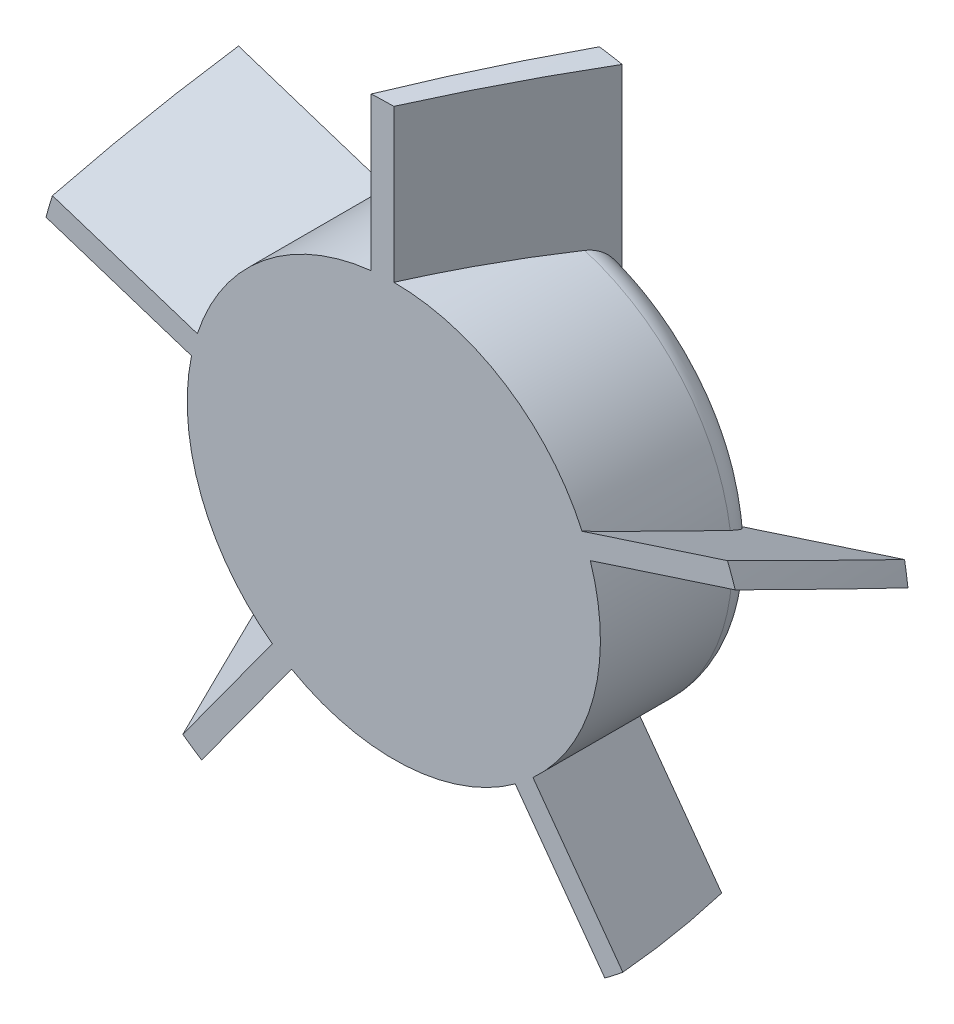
ISO-10303-21;
HEADER;
FILE_DESCRIPTION(('STEP AP214'),'2;1');
FILE_NAME('part.step','',(''),(''),'','','');
FILE_SCHEMA(('AUTOMOTIVE_DESIGN { 1 0 10303 214 1 1 1 1 }'));
ENDSEC;
DATA;
#1=APPLICATION_CONTEXT('core data for automotive mechanical design processes');
#2=APPLICATION_PROTOCOL_DEFINITION('international standard','automotive_design',2000,#1);
#3=PRODUCT_CONTEXT('',#1,'mechanical');
#4=PRODUCT('Part','Part','',(#3));
#5=PRODUCT_RELATED_PRODUCT_CATEGORY('part','',(#4));
#6=PRODUCT_DEFINITION_FORMATION('','',#4);
#7=PRODUCT_DEFINITION_CONTEXT('part definition',#1,'design');
#8=PRODUCT_DEFINITION('design','',#6,#7);
#9=PRODUCT_DEFINITION_SHAPE('','',#8);
#10=(LENGTH_UNIT() NAMED_UNIT(*) SI_UNIT(.MILLI.,.METRE.));
#11=(NAMED_UNIT(*) PLANE_ANGLE_UNIT() SI_UNIT($,.RADIAN.));
#12=(NAMED_UNIT(*) SI_UNIT($,.STERADIAN.) SOLID_ANGLE_UNIT());
#13=UNCERTAINTY_MEASURE_WITH_UNIT(LENGTH_MEASURE(1.E-05),#10,'distance_accuracy_value','');
#14=(GEOMETRIC_REPRESENTATION_CONTEXT(3) GLOBAL_UNCERTAINTY_ASSIGNED_CONTEXT((#13)) GLOBAL_UNIT_ASSIGNED_CONTEXT((#10,
#11,#12)) REPRESENTATION_CONTEXT('',''));
#15=CARTESIAN_POINT('',(0.,0.,0.));
#16=DIRECTION('',(0.,0.,1.));
#17=DIRECTION('',(1.,0.,0.));
#18=AXIS2_PLACEMENT_3D('',#15,#16,#17);
#19=CARTESIAN_POINT('',(0.,0.,6.1));
#20=DIRECTION('',(0.28188945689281,0.867566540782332,0.409715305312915));
#21=DIRECTION('',(0.,-0.427032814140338,0.904236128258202));
#22=AXIS2_PLACEMENT_3D('',#19,#20,#21);
#23=PLANE('',#22);
#24=CARTESIAN_POINT('',(-6.5820505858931,4.54715406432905,0.999999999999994));
#25=CARTESIAN_POINT('',(-6.56554313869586,4.57108882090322,0.937961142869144));
#26=CARTESIAN_POINT('',(-6.54332041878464,4.59279357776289,0.876712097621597));
#27=CARTESIAN_POINT('',(-6.4887899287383,4.63138902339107,0.75746908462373));
#28=CARTESIAN_POINT('',(-6.45651059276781,4.6482930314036,0.699466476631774));
#29=CARTESIAN_POINT('',(-6.38316226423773,4.67704814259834,0.588113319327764));
#30=CARTESIAN_POINT('',(-6.34210692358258,4.68890700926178,0.534755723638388));
#31=CARTESIAN_POINT('',(-6.25242714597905,4.707457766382,0.433773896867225));
#32=CARTESIAN_POINT('',(-6.20379813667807,4.7141465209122,0.386153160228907));
#33=CARTESIAN_POINT('',(-6.09718602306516,4.72248153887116,0.295153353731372));
#34=CARTESIAN_POINT('',(-6.03881925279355,4.72380530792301,0.252193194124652));
#35=CARTESIAN_POINT('',(-5.91655820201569,4.72045224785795,0.175176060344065));
#36=CARTESIAN_POINT('',(-5.85265923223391,4.71577028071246,0.141126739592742));
#37=CARTESIAN_POINT('',(-5.72044106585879,4.70030395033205,0.0829086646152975));
#38=CARTESIAN_POINT('',(-5.65208521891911,4.68946123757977,0.0588382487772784));
#39=CARTESIAN_POINT('',(-5.51364806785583,4.66168477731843,0.0224079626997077));
#40=CARTESIAN_POINT('',(-5.44357293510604,4.64477048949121,0.0100111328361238));
#41=CARTESIAN_POINT('',(-5.34233779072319,4.61595860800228,0.00136880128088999));
#42=CARTESIAN_POINT('',(-5.31089254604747,4.60639001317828,-4.5675549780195E-06));
#43=CARTESIAN_POINT('',(-5.27964302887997,4.59623427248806,0.));
#44=B_SPLINE_CURVE_WITH_KNOTS('',3,(#24,#25,#26,#27,#28,#29,#30,#31,#32,#33,#34,#35,#36,#37,#38,
#39,#40,#41,#42,#43),.UNSPECIFIED.,.F.,.F.,(4,2,2,2,2,2,2,2,2,4),(0.,0.205103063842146,
0.409631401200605,0.613843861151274,0.818180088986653,1.03463183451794,1.25126888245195,
1.46999278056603,1.68802182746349,1.78659161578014),.UNSPECIFIED.);
#45=CARTESIAN_POINT('',(-6.5820505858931,4.54715406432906,0.999999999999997));
#46=VERTEX_POINT('',#45);
#47=CARTESIAN_POINT('',(-5.27964302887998,4.59623427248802,0.));
#48=VERTEX_POINT('',#47);
#49=EDGE_CURVE('E446',#46,#48,#44,.T.);
#50=ORIENTED_EDGE('',*,*,#49,.T.);
#51=CARTESIAN_POINT('',(-5.27964302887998,4.59623427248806,0.));
#52=CARTESIAN_POINT('',(-12.1137047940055,6.81675554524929,0.));
#53=B_SPLINE_CURVE_WITH_KNOTS('',1,(#51,#52),.UNSPECIFIED.,.F.,.F.,(2,2),(0.,1.),.UNSPECIFIED.);
#54=CARTESIAN_POINT('',(-12.1137047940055,6.81675554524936,0.));
#55=VERTEX_POINT('',#54);
#56=EDGE_CURVE('E283',#48,#55,#53,.T.);
#57=ORIENTED_EDGE('',*,*,#56,.T.);
#58=CARTESIAN_POINT('',(0.,0.,6.1));
#59=DIRECTION('',(0.28188945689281,0.867566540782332,0.409715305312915));
#60=DIRECTION('',(0.126608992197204,0.389662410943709,-0.912213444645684));
#61=AXIS2_PLACEMENT_3D('',#58,#59,#60);
#62=ELLIPSE('',#61,33.9259964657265,13.9);
#63=CARTESIAN_POINT('',(-13.2196855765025,4.29533622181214,6.1));
#64=VERTEX_POINT('',#63);
#65=EDGE_CURVE('E908',#55,#64,#62,.T.);
#66=ORIENTED_EDGE('',*,*,#65,.T.);
#67=DIRECTION('',(-0.951056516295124,0.309016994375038,0.));
#68=VECTOR('',#67,1.);
#69=CARTESIAN_POINT('',(-7.608452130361,2.472135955,6.1));
#70=LINE('',#69,#68);
#71=CARTESIAN_POINT('',(-7.60845213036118,2.47213595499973,6.1));
#72=VERTEX_POINT('',#71);
#73=EDGE_CURVE('E448',#72,#64,#70,.T.);
#74=ORIENTED_EDGE('',*,*,#73,.F.);
#75=CARTESIAN_POINT('',(0.,0.,6.1));
#76=DIRECTION('',(0.28188945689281,0.867566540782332,0.409715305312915));
#77=DIRECTION('',(-0.126608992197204,-0.389662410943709,0.912213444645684));
#78=AXIS2_PLACEMENT_3D('',#75,#76,#77);
#79=ELLIPSE('',#78,19.5257533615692,8.);
#80=EDGE_CURVE('E687',#72,#46,#79,.F.);
#81=ORIENTED_EDGE('',*,*,#80,.T.);
#82=EDGE_LOOP('',(#50,#57,#66,#74,#81));
#83=FACE_BOUND('',#82,.T.);
#84=ADVANCED_FACE('F16',(#83),#23,.T.);
#85=CARTESIAN_POINT('',(1.857477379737,0.,0.));
#86=DIRECTION('',(-0.912213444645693,0.,-0.409715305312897));
#87=DIRECTION('',(-0.409715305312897,0.,0.912213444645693));
#88=AXIS2_PLACEMENT_3D('',#85,#86,#87);
#89=PLANE('',#88);
#90=CARTESIAN_POINT('',(1.857477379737,6.749057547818,0.));
#91=CARTESIAN_POINT('',(1.85749037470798,6.80884483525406,-2.89327420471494E-05));
#92=CARTESIAN_POINT('',(1.85524148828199,6.86851002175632,0.00497811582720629));
#93=CARTESIAN_POINT('',(1.84661035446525,6.98580594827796,0.0241949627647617));
#94=CARTESIAN_POINT('',(1.84024451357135,7.04344381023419,0.0383682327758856));
#95=CARTESIAN_POINT('',(1.82378096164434,7.15527790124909,0.0750236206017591));
#96=CARTESIAN_POINT('',(1.81369095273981,7.20948096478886,0.0974885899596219));
#97=CARTESIAN_POINT('',(1.7901793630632,7.31344229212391,0.149836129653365));
#98=CARTESIAN_POINT('',(1.77675456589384,7.36319620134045,0.179725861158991));
#99=CARTESIAN_POINT('',(1.74587345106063,7.46073109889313,0.24848133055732));
#100=CARTESIAN_POINT('',(1.72819032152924,7.50808442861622,0.287852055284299));
#101=CARTESIAN_POINT('',(1.68997671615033,7.59538163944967,0.372932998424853));
#102=CARTESIAN_POINT('',(1.6694451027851,7.63532254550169,0.418645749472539));
#103=CARTESIAN_POINT('',(1.62479810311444,7.70897210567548,0.518050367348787));
#104=CARTESIAN_POINT('',(1.60054305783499,7.74217695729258,0.57205317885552));
#105=CARTESIAN_POINT('',(1.55012127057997,7.79826996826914,0.684315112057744));
#106=CARTESIAN_POINT('',(1.52395644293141,7.82116829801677,0.742569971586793));
#107=CARTESIAN_POINT('',(1.48265726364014,7.84795876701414,0.834520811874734));
#108=CARTESIAN_POINT('',(1.46793191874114,7.85575659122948,0.867306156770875));
#109=CARTESIAN_POINT('',(1.43826892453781,7.86796425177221,0.933349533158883));
#110=CARTESIAN_POINT('',(1.42333160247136,7.87237883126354,0.966606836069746));
#111=CARTESIAN_POINT('',(1.40833325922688,7.87506174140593,0.999999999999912));
#112=B_SPLINE_CURVE_WITH_KNOTS('',3,(#90,#91,#92,#93,#94,#95,#96,#97,#98,#99,#100,#101,#102,
#103,#104,#105,#106,#107,#108,#109,#110,#111),.UNSPECIFIED.,.F.,.F.,(4,2,2,2,2,2,2,2,2,2,4),(0.,
0.178934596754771,0.357160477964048,0.535019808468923,0.713051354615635,0.904431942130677,
1.09588917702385,1.2985910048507,1.50109236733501,1.6112800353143,1.72131294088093),.UNSPECIFIED.);
#113=CARTESIAN_POINT('',(1.857477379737,6.749057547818,0.));
#114=VERTEX_POINT('',#113);
#115=CARTESIAN_POINT('',(1.40833325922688,7.87506174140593,0.999999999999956));
#116=VERTEX_POINT('',#115);
#117=EDGE_CURVE('E681',#114,#116,#112,.T.);
#118=ORIENTED_EDGE('',*,*,#117,.T.);
#119=CARTESIAN_POINT('',(0.,0.,4.1355932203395));
#120=DIRECTION('',(-0.912213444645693,0.,-0.409715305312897));
#121=DIRECTION('',(-0.409715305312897,0.,0.912213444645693));
#122=AXIS2_PLACEMENT_3D('',#119,#120,#121);
#123=ELLIPSE('',#122,19.5257533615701,8.);
#124=CARTESIAN_POINT('',(-0.882301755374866,7.95119762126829,6.1));
#125=VERTEX_POINT('',#124);
#126=EDGE_CURVE('E683',#125,#116,#123,.T.);
#127=ORIENTED_EDGE('',*,*,#126,.F.);
#128=DIRECTION('',(0.,1.,0.));
#129=VECTOR('',#128,1.);
#130=CARTESIAN_POINT('',(-0.882301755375,0.,6.1));
#131=LINE('',#130,#129);
#132=CARTESIAN_POINT('',(-0.882301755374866,13.871969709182,6.1));
#133=VERTEX_POINT('',#132);
#134=EDGE_CURVE('E695',#133,#125,#131,.F.);
#135=ORIENTED_EDGE('',*,*,#134,.F.);
#136=CARTESIAN_POINT('',(0.,0.,4.1355932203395));
#137=DIRECTION('',(-0.912213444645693,0.,-0.409715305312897));
#138=DIRECTION('',(0.409715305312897,0.,-0.912213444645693));
#139=AXIS2_PLACEMENT_3D('',#136,#137,#138);
#140=ELLIPSE('',#139,33.925996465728,13.9);
#141=CARTESIAN_POINT('',(1.857477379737,13.7753322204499,0.));
#142=VERTEX_POINT('',#141);
#143=EDGE_CURVE('E700',#133,#142,#140,.T.);
#144=ORIENTED_EDGE('',*,*,#143,.T.);
#145=CARTESIAN_POINT('',(1.857477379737,6.74905754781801,0.));
#146=CARTESIAN_POINT('',(1.857477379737,13.7753322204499,0.));
#147=B_SPLINE_CURVE_WITH_KNOTS('',1,(#145,#146),.UNSPECIFIED.,.F.,.F.,(2,2),(0.,1.),.UNSPECIFIED.);
#148=EDGE_CURVE('E273',#114,#142,#147,.T.);
#149=ORIENTED_EDGE('',*,*,#148,.F.);
#150=EDGE_LOOP('',(#118,#127,#135,#144,#149));
#151=FACE_BOUND('',#150,.T.);
#152=ADVANCED_FACE('F427',(#151),#89,.T.);
#153=CARTESIAN_POINT('',(0.,0.,1.));
#154=DIRECTION('',(0.,0.,1.));
#155=DIRECTION('',(0.677638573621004,0.735395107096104,0.));
#156=AXIS2_PLACEMENT_3D('',#153,#154,#155);
#157=TOROIDAL_SURFACE('',#156,7.,1.);
#158=ORIENTED_EDGE('',*,*,#49,.F.);
#159=CARTESIAN_POINT('',(0.,0.,1.));
#160=DIRECTION('',(0.,0.,1.));
#161=DIRECTION('',(1.,0.,0.));
#162=AXIS2_PLACEMENT_3D('',#159,#160,#161);
#163=CIRCLE('',#162,8.);
#164=EDGE_CURVE('E692',#116,#46,#163,.T.);
#165=ORIENTED_EDGE('',*,*,#164,.F.);
#166=ORIENTED_EDGE('',*,*,#117,.F.);
#167=CARTESIAN_POINT('',(0.,0.,0.));
#168=DIRECTION('',(0.,0.,1.));
#169=DIRECTION('',(0.265353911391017,0.964151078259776,0.));
#170=AXIS2_PLACEMENT_3D('',#167,#168,#169);
#171=CIRCLE('',#170,6.99999999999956);
#172=EDGE_CURVE('E278',#48,#114,#171,.F.);
#173=ORIENTED_EDGE('',*,*,#172,.F.);
#174=EDGE_LOOP('',(#158,#165,#166,#173));
#175=FACE_BOUND('',#174,.T.);
#176=ADVANCED_FACE('F421',(#175),#157,.T.);
#177=CARTESIAN_POINT('',(0.,0.,6.1));
#178=DIRECTION('',(0.912213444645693,0.,0.409715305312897));
#179=DIRECTION('',(0.409715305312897,0.,-0.912213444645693));
#180=AXIS2_PLACEMENT_3D('',#177,#178,#179);
#181=PLANE('',#180);
#182=CARTESIAN_POINT('',(2.29063501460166,7.66504998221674,0.999999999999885));
#183=CARTESIAN_POINT('',(2.31849940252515,7.65674671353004,0.937961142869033));
#184=CARTESIAN_POINT('',(2.34600905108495,7.64231878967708,0.876712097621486));
#185=CARTESIAN_POINT('',(2.39956634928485,7.60238386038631,0.757469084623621));
#186=CARTESIAN_POINT('',(2.42561787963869,7.57690801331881,0.699466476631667));
#187=CARTESIAN_POINT('',(2.47563149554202,7.51603542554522,0.588113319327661));
#188=CARTESIAN_POINT('',(2.49959674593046,7.48065406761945,0.534755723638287));
#189=CARTESIAN_POINT('',(2.5449521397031,7.40109602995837,0.433773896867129));
#190=CARTESIAN_POINT('',(2.56634071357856,7.35691403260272,0.386153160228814));
#191=CARTESIAN_POINT('',(2.60721274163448,7.25809554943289,0.295153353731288));
#192=CARTESIAN_POINT('',(2.62650804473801,7.20299451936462,0.252193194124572));
#193=CARTESIAN_POINT('',(2.6610998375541,7.08568119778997,0.175176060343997));
#194=CARTESIAN_POINT('',(2.67639288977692,7.0234628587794,0.14112673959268));
#195=CARTESIAN_POINT('',(2.70254119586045,6.89293655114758,0.0829086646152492));
#196=CARTESIAN_POINT('',(2.71335228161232,6.82457569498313,0.0588382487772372));
#197=CARTESIAN_POINT('',(2.72971473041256,6.68433074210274,0.0224079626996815));
#198=CARTESIAN_POINT('',(2.73528269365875,6.61245852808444,0.0100111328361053));
#199=CARTESIAN_POINT('',(2.73916434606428,6.50727482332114,0.00136880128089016));
#200=CARTESIAN_POINT('',(2.7397811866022,6.47441176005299,-4.56755497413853E-06));
#201=CARTESIAN_POINT('',(2.73977913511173,6.44155340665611,0.));
#202=B_SPLINE_CURVE_WITH_KNOTS('',3,(#182,#183,#184,#185,#186,#187,#188,#189,#190,#191,#192,
#193,#194,#195,#196,#197,#198,#199,#200,#201),.UNSPECIFIED.,.F.,.F.,(4,2,2,2,2,2,2,2,2,4),(0.,
0.205103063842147,0.409631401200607,0.613843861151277,0.818180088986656,1.03463183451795,
1.25126888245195,1.46999278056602,1.68802182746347,1.78659161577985),.UNSPECIFIED.);
#203=CARTESIAN_POINT('',(2.29063501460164,7.66504998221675,0.999999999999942));
#204=VERTEX_POINT('',#203);
#205=CARTESIAN_POINT('',(2.73977913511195,6.4415534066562,0.));
#206=VERTEX_POINT('',#205);
#207=EDGE_CURVE('E699',#204,#206,#202,.T.);
#208=ORIENTED_EDGE('',*,*,#207,.T.);
#209=CARTESIAN_POINT('',(2.73977913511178,6.44155340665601,0.));
#210=CARTESIAN_POINT('',(2.73977913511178,13.6273111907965,0.));
#211=B_SPLINE_CURVE_WITH_KNOTS('',1,(#209,#210),.UNSPECIFIED.,.F.,.F.,(2,2),(0.,1.),.UNSPECIFIED.);
#212=CARTESIAN_POINT('',(2.73977913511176,13.6273111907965,0.));
#213=VERTEX_POINT('',#212);
#214=EDGE_CURVE('E262',#206,#213,#211,.T.);
#215=ORIENTED_EDGE('',*,*,#214,.T.);
#216=CARTESIAN_POINT('',(0.,0.,6.1));
#217=DIRECTION('',(0.912213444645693,0.,0.409715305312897));
#218=DIRECTION('',(0.409715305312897,0.,-0.912213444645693));
#219=AXIS2_PLACEMENT_3D('',#216,#217,#218);
#220=ELLIPSE('',#219,33.925996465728,13.9);
#221=CARTESIAN_POINT('',(0.,13.9,6.1));
#222=VERTEX_POINT('',#221);
#223=EDGE_CURVE('E703',#213,#222,#220,.T.);
#224=ORIENTED_EDGE('',*,*,#223,.T.);
#225=DIRECTION('',(0.,1.,0.));
#226=VECTOR('',#225,1.);
#227=CARTESIAN_POINT('',(0.,0.,6.1));
#228=LINE('',#227,#226);
#229=CARTESIAN_POINT('',(0.,8.,6.1));
#230=VERTEX_POINT('',#229);
#231=EDGE_CURVE('E713',#230,#222,#228,.T.);
#232=ORIENTED_EDGE('',*,*,#231,.F.);
#233=CARTESIAN_POINT('',(0.,0.,6.1));
#234=DIRECTION('',(0.912213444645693,0.,0.409715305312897));
#235=DIRECTION('',(-0.409715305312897,0.,0.912213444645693));
#236=AXIS2_PLACEMENT_3D('',#233,#234,#235);
#237=ELLIPSE('',#236,19.5257533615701,8.);
#238=EDGE_CURVE('E1027',#230,#204,#237,.F.);
#239=ORIENTED_EDGE('',*,*,#238,.T.);
#240=EDGE_LOOP('',(#208,#215,#224,#232,#239));
#241=FACE_BOUND('',#240,.T.);
#242=ADVANCED_FACE('F426',(#241),#181,.T.);
#243=CARTESIAN_POINT('',(0.5739920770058,-1.76656596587,0.));
#244=DIRECTION('',(-0.28188945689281,0.867566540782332,-0.409715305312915));
#245=DIRECTION('',(0.,0.427032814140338,0.904236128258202));
#246=AXIS2_PLACEMENT_3D('',#243,#244,#245);
#247=PLANE('',#246);
#248=CARTESIAN_POINT('',(6.99272723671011,0.319007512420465,0.));
#249=CARTESIAN_POINT('',(7.04959234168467,0.337470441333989,-2.89327419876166E-05));
#250=CARTESIAN_POINT('',(7.10564236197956,0.35804681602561,0.00497811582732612));
#251=CARTESIAN_POINT('',(7.21453025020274,0.402501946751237,0.0241949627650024));
#252=CARTESIAN_POINT('',(7.26737996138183,0.426367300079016,0.0383682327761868));
#253=CARTESIAN_POINT('',(7.36865298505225,0.47658370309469,0.0750236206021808));
#254=CARTESIAN_POINT('',(7.41708517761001,0.502929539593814,0.0974885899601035));
#255=CARTESIAN_POINT('',(7.50869279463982,0.557416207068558,0.149836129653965));
#256=CARTESIAN_POINT('',(7.55186308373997,0.585558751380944,0.179725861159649));
#257=CARTESIAN_POINT('',(7.63508149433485,0.645068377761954,0.248481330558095));
#258=CARTESIAN_POINT('',(7.67465279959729,0.676519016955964,0.287852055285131));
#259=CARTESIAN_POINT('',(7.74586872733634,0.739838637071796,0.372932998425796));
#260=CARTESIAN_POINT('',(7.77751016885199,0.771707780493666,0.418645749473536));
#261=CARTESIAN_POINT('',(7.83375838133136,0.836928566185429,0.518050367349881));
#262=CARTESIAN_POINT('',(7.85784285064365,0.870257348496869,0.572053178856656));
#263=CARTESIAN_POINT('',(7.89560928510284,0.935545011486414,0.684315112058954));
#264=CARTESIAN_POINT('',(7.90930151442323,0.967505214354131,0.742569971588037));
#265=CARTESIAN_POINT('',(7.9220186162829,1.0150617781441,0.834520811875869));
#266=CARTESIAN_POINT('',(7.92488440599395,1.03147607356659,0.867306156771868));
#267=CARTESIAN_POINT('',(7.9273282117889,1.0634596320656,0.933349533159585));
#268=CARTESIAN_POINT('',(7.92691084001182,1.07903004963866,0.966606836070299));
#269=CARTESIAN_POINT('',(7.92482769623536,1.09412338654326,1.00000000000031));
#270=B_SPLINE_CURVE_WITH_KNOTS('',3,(#248,#249,#250,#251,#252,#253,#254,#255,#256,#257,#258,
#259,#260,#261,#262,#263,#264,#265,#266,#267,#268,#269),.UNSPECIFIED.,.F.,.F.,(4,2,2,2,2,2,2,2,
2,2,4),(0.,0.178934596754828,0.357160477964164,0.535019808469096,0.713051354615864,
0.904431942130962,1.09588917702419,1.29859100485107,1.50109236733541,1.61128003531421,
1.72131294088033),.UNSPECIFIED.);
#271=CARTESIAN_POINT('',(6.99272736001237,0.319007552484,0.));
#272=VERTEX_POINT('',#271);
#273=CARTESIAN_POINT('',(7.92482769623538,1.09412338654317,1.00000000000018));
#274=VERTEX_POINT('',#273);
#275=EDGE_CURVE('E1030',#272,#274,#270,.T.);
#276=ORIENTED_EDGE('',*,*,#275,.T.);
#277=CARTESIAN_POINT('',(0.,0.,4.13559322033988));
#278=DIRECTION('',(-0.28188945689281,0.867566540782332,-0.409715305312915));
#279=DIRECTION('',(-0.126608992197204,0.389662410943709,0.912213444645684));
#280=AXIS2_PLACEMENT_3D('',#277,#278,#279);
#281=ELLIPSE('',#280,19.5257533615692,8.);
#282=CARTESIAN_POINT('',(7.28939207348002,3.29617402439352,6.1));
#283=VERTEX_POINT('',#282);
#284=EDGE_CURVE('E1035',#283,#274,#281,.T.);
#285=ORIENTED_EDGE('',*,*,#284,.F.);
#286=DIRECTION('',(-0.951056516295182,-0.309016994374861,0.));
#287=VECTOR('',#286,1.);
#288=CARTESIAN_POINT('',(12.92038094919,5.12579321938,6.1));
#289=LINE('',#288,#287);
#290=CARTESIAN_POINT('',(12.9203809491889,5.12579321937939,6.1));
#291=VERTEX_POINT('',#290);
#292=EDGE_CURVE('E933',#291,#283,#289,.T.);
#293=ORIENTED_EDGE('',*,*,#292,.F.);
#294=CARTESIAN_POINT('',(0.,0.,4.13559322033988));
#295=DIRECTION('',(-0.28188945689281,0.867566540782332,-0.409715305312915));
#296=DIRECTION('',(0.126608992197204,-0.389662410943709,-0.912213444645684));
#297=AXIS2_PLACEMENT_3D('',#294,#295,#296);
#298=ELLIPSE('',#297,33.9259964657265,13.9);
#299=CARTESIAN_POINT('',(13.6751115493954,2.49024579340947,0.));
#300=VERTEX_POINT('',#299);
#301=EDGE_CURVE('E924',#291,#300,#298,.T.);
#302=ORIENTED_EDGE('',*,*,#301,.T.);
#303=CARTESIAN_POINT('',(13.6751115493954,2.49024579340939,0.));
#304=CARTESIAN_POINT('',(6.9927272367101,0.319007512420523,0.));
#305=B_SPLINE_CURVE_WITH_KNOTS('',1,(#303,#304),.UNSPECIFIED.,.F.,.F.,(2,2),(0.,1.),.UNSPECIFIED.);
#306=EDGE_CURVE('E251',#300,#272,#305,.T.);
#307=ORIENTED_EDGE('',*,*,#306,.T.);
#308=EDGE_LOOP('',(#276,#285,#293,#302,#307));
#309=FACE_BOUND('',#308,.T.);
#310=ADVANCED_FACE('F650',(#309),#247,.T.);
#311=CARTESIAN_POINT('',(0.,0.,1.));
#312=DIRECTION('',(0.,0.,1.));
#313=DIRECTION('',(-0.677638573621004,-0.735395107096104,0.));
#314=AXIS2_PLACEMENT_3D('',#311,#312,#313);
#315=TOROIDAL_SURFACE('',#314,7.,1.);
#316=ORIENTED_EDGE('',*,*,#207,.F.);
#317=CARTESIAN_POINT('',(0.,0.,1.));
#318=DIRECTION('',(0.,0.,1.));
#319=DIRECTION('',(1.,0.,0.));
#320=AXIS2_PLACEMENT_3D('',#317,#318,#319);
#321=CIRCLE('',#320,8.);
#322=EDGE_CURVE('E932',#274,#204,#321,.T.);
#323=ORIENTED_EDGE('',*,*,#322,.F.);
#324=ORIENTED_EDGE('',*,*,#275,.F.);
#325=CARTESIAN_POINT('',(0.,0.,0.));
#326=DIRECTION('',(0.,0.,1.));
#327=DIRECTION('',(0.998961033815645,0.0455725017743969,0.));
#328=AXIS2_PLACEMENT_3D('',#325,#326,#327);
#329=CIRCLE('',#328,7.00000000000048);
#330=EDGE_CURVE('E257',#206,#272,#329,.F.);
#331=ORIENTED_EDGE('',*,*,#330,.F.);
#332=EDGE_LOOP('',(#316,#323,#324,#331));
#333=FACE_BOUND('',#332,.T.);
#334=ADVANCED_FACE('F642',(#333),#315,.T.);
#335=CARTESIAN_POINT('',(0.,0.,6.1));
#336=DIRECTION('',(0.28188945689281,-0.867566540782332,0.409715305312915));
#337=DIRECTION('',(0.,-0.427032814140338,-0.904236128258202));
#338=AXIS2_PLACEMENT_3D('',#335,#336,#337);
#339=PLANE('',#338);
#340=CARTESIAN_POINT('',(7.99774088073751,0.190107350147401,1.00000000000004));
#341=CARTESIAN_POINT('',(7.99845457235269,0.16104089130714,0.937961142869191));
#342=CARTESIAN_POINT('',(7.99323375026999,0.130419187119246,0.876712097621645));
#343=CARTESIAN_POINT('',(7.97180349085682,0.0671425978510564,0.757469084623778));
#344=CARTESIAN_POINT('',(7.95562488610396,0.0344936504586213,0.699466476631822));
#345=CARTESIAN_POINT('',(7.91318667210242,-0.031882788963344,0.588113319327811));
#346=CARTESIAN_POINT('',(7.88694267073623,-0.0656085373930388,0.534755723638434));
#347=CARTESIAN_POINT('',(7.82529406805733,-0.133328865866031,0.433773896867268));
#348=CARTESIAN_POINT('',(7.78988392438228,-0.16732359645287,0.386153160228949));
#349=CARTESIAN_POINT('',(7.70853211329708,-0.236731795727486,0.29515335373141));
#350=CARTESIAN_POINT('',(7.66209049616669,-0.272109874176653,0.252193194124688));
#351=CARTESIAN_POINT('',(7.56120834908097,-0.341260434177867,0.175176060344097));
#352=CARTESIAN_POINT('',(7.50676100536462,-0.375031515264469,0.141126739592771));
#353=CARTESIAN_POINT('',(7.39070338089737,-0.44023487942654,0.0829086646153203));
#354=CARTESIAN_POINT('',(7.32902915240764,-0.471641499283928,0.0588382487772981));
#355=CARTESIAN_POINT('',(7.20070455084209,-0.530541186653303,0.0224079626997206));
#356=CARTESIAN_POINT('',(7.13407060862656,-0.558046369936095,0.0100111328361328));
#357=CARTESIAN_POINT('',(7.03523445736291,-0.594241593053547,0.00136880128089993));
#358=CARTESIAN_POINT('',(7.00417044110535,-0.604983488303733,-4.5675549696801E-06));
#359=CARTESIAN_POINT('',(6.97291965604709,-0.615135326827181,0.));
#360=B_SPLINE_CURVE_WITH_KNOTS('',3,(#340,#341,#342,#343,#344,#345,#346,#347,#348,#349,#350,
#351,#352,#353,#354,#355,#356,#357,#358,#359),.UNSPECIFIED.,.F.,.F.,(4,2,2,2,2,2,2,2,2,4),(0.,
0.205103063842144,0.409631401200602,0.613843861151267,0.818180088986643,1.03463183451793,
1.25126888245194,1.46999278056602,1.68802182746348,1.78659161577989),.UNSPECIFIED.);
#361=CARTESIAN_POINT('',(7.99774088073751,0.190107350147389,1.00000000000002));
#362=VERTEX_POINT('',#361);
#363=CARTESIAN_POINT('',(6.97291965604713,-0.615135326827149,0.));
#364=VERTEX_POINT('',#363);
#365=EDGE_CURVE('E753',#362,#364,#360,.T.);
#366=ORIENTED_EDGE('',*,*,#365,.T.);
#367=CARTESIAN_POINT('',(6.97291965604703,-0.615135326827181,0.));
#368=CARTESIAN_POINT('',(13.8069814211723,1.60538594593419,0.));
#369=B_SPLINE_CURVE_WITH_KNOTS('',1,(#367,#368),.UNSPECIFIED.,.F.,.F.,(2,2),(0.,1.),.UNSPECIFIED.);
#370=CARTESIAN_POINT('',(13.8069814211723,1.60538594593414,0.));
#371=VERTEX_POINT('',#370);
#372=EDGE_CURVE('E240',#364,#371,#369,.T.);
#373=ORIENTED_EDGE('',*,*,#372,.T.);
#374=CARTESIAN_POINT('',(0.,0.,6.1));
#375=DIRECTION('',(0.28188945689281,-0.867566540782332,0.409715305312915));
#376=DIRECTION('',(0.126608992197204,-0.389662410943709,-0.912213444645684));
#377=AXIS2_PLACEMENT_3D('',#374,#375,#376);
#378=ELLIPSE('',#377,33.9259964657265,13.9);
#379=CARTESIAN_POINT('',(13.2196855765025,4.29533622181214,6.1));
#380=VERTEX_POINT('',#379);
#381=EDGE_CURVE('E759',#371,#380,#378,.T.);
#382=ORIENTED_EDGE('',*,*,#381,.T.);
#383=DIRECTION('',(0.951056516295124,0.309016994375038,0.));
#384=VECTOR('',#383,1.);
#385=CARTESIAN_POINT('',(7.608452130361,2.472135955,6.1));
#386=LINE('',#385,#384);
#387=CARTESIAN_POINT('',(7.60845213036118,2.47213595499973,6.1));
#388=VERTEX_POINT('',#387);
#389=EDGE_CURVE('E755',#388,#380,#386,.T.);
#390=ORIENTED_EDGE('',*,*,#389,.F.);
#391=CARTESIAN_POINT('',(0.,0.,6.1));
#392=DIRECTION('',(0.28188945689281,-0.867566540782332,0.409715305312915));
#393=DIRECTION('',(-0.126608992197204,0.389662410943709,0.912213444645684));
#394=AXIS2_PLACEMENT_3D('',#391,#392,#393);
#395=ELLIPSE('',#394,19.5257533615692,8.);
#396=EDGE_CURVE('E758',#388,#362,#395,.F.);
#397=ORIENTED_EDGE('',*,*,#396,.T.);
#398=EDGE_LOOP('',(#366,#373,#382,#390,#397));
#399=FACE_BOUND('',#398,.T.);
#400=ADVANCED_FACE('F634',(#399),#339,.T.);
#401=CARTESIAN_POINT('',(-1.502730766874,-1.091797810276,0.));
#402=DIRECTION('',(0.737996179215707,0.536185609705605,-0.409715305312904));
#403=DIRECTION('',(-0.587785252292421,0.809016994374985,0.));
#404=AXIS2_PLACEMENT_3D('',#401,#402,#403);
#405=PLANE('',#404);
#406=CARTESIAN_POINT('',(2.46426572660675,-6.55190006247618,0.));
#407=CARTESIAN_POINT('',(2.4993972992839,-6.60027663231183,-2.89327420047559E-05));
#408=CARTESIAN_POINT('',(2.53628700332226,-6.64722491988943,0.00497811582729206));
#409=CARTESIAN_POINT('',(2.61221455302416,-6.73704606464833,0.0241949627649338));
#410=CARTESIAN_POINT('',(2.65124331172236,-6.77993432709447,0.0383682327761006));
#411=CARTESIAN_POINT('',(2.7302970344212,-6.86073297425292,0.0750236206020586));
#412=CARTESIAN_POINT('',(2.77031978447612,-6.89865341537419,0.097488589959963));
#413=CARTESIAN_POINT('',(2.85044799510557,-6.96894013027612,0.149836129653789));
#414=CARTESIAN_POINT('',(2.890553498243,-7.0013009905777,0.179725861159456));
#415=CARTESIAN_POINT('',(2.97286641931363,-7.06205691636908,0.248481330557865));
#416=CARTESIAN_POINT('',(3.01500596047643,-7.08997268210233,0.287852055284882));
#417=CARTESIAN_POINT('',(3.09723342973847,-7.13813621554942,0.37293299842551));
#418=CARTESIAN_POINT('',(3.13732052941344,-7.15838090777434,0.418645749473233));
#419=CARTESIAN_POINT('',(3.21673083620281,-7.19172180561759,0.518050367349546));
#420=CARTESIAN_POINT('',(3.2558709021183,-7.20432833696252,0.572053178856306));
#421=CARTESIAN_POINT('',(3.32963362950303,-7.22007135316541,0.684315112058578));
#422=CARTESIAN_POINT('',(3.36426072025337,-7.2232171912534,0.742569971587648));
#423=CARTESIAN_POINT('',(3.41341950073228,-7.22061608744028,0.834520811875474));
#424=CARTESIAN_POINT('',(3.42991600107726,-7.21826931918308,0.867306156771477));
#425=CARTESIAN_POINT('',(3.46108935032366,-7.21071005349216,0.933349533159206));
#426=CARTESIAN_POINT('',(3.47576872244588,-7.20550158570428,0.966606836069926));
#427=CARTESIAN_POINT('',(3.489479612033,-7.19885630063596,0.999999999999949));
#428=B_SPLINE_CURVE_WITH_KNOTS('',3,(#406,#407,#408,#409,#410,#411,#412,#413,#414,#415,#416,
#417,#418,#419,#420,#421,#422,#423,#424,#425,#426,#427),.UNSPECIFIED.,.F.,.F.,(4,2,2,2,2,2,2,2,
2,2,4),(0.,0.178934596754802,0.357160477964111,0.535019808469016,0.713051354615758,
0.904431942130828,1.09588917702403,1.29859100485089,1.50109236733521,1.61128003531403,
1.72131294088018),.UNSPECIFIED.);
#429=CARTESIAN_POINT('',(2.46426580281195,-6.55190016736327,0.));
#430=VERTEX_POINT('',#429);
#431=CARTESIAN_POINT('',(3.48947961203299,-7.19885630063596,0.999999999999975));
#432=VERTEX_POINT('',#431);
#433=EDGE_CURVE('E762',#430,#432,#428,.T.);
#434=ORIENTED_EDGE('',*,*,#433,.T.);
#435=CARTESIAN_POINT('',(0.,0.,4.13559322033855));
#436=DIRECTION('',(0.737996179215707,0.536185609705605,-0.409715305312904));
#437=DIRECTION('',(0.331466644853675,0.240824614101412,0.912213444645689));
#438=AXIS2_PLACEMENT_3D('',#435,#436,#437);
#439=ELLIPSE('',#438,19.5257533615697,8.);
#440=CARTESIAN_POINT('',(5.38739381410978,-5.91405004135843,6.1));
#441=VERTEX_POINT('',#440);
#442=EDGE_CURVE('E763',#441,#432,#439,.T.);
#443=ORIENTED_EDGE('',*,*,#442,.F.);
#444=DIRECTION('',(-0.58778525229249,0.809016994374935,0.));
#445=VECTOR('',#444,1.);
#446=CARTESIAN_POINT('',(8.86753632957,-10.7040552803,6.1));
#447=LINE('',#446,#445);
#448=CARTESIAN_POINT('',(8.86753632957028,-10.7040552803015,6.1));
#449=VERTEX_POINT('',#448);
#450=EDGE_CURVE('E771',#449,#441,#447,.T.);
#451=ORIENTED_EDGE('',*,*,#450,.F.);
#452=CARTESIAN_POINT('',(0.,0.,4.13559322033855));
#453=DIRECTION('',(0.737996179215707,0.536185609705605,-0.409715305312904));
#454=DIRECTION('',(-0.331466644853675,-0.240824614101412,-0.912213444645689));
#455=AXIS2_PLACEMENT_3D('',#452,#453,#454);
#456=ELLIPSE('',#455,33.9259964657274,13.9);
#457=CARTESIAN_POINT('',(6.59420635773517,-12.2362756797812,0.));
#458=VERTEX_POINT('',#457);
#459=EDGE_CURVE('E774',#449,#458,#456,.T.);
#460=ORIENTED_EDGE('',*,*,#459,.T.);
#461=CARTESIAN_POINT('',(6.59420635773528,-12.2362756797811,0.));
#462=CARTESIAN_POINT('',(2.46426572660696,-6.55190006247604,0.));
#463=B_SPLINE_CURVE_WITH_KNOTS('',1,(#461,#462),.UNSPECIFIED.,.F.,.F.,(2,2),(0.,1.),.UNSPECIFIED.);
#464=EDGE_CURVE('E205',#458,#430,#463,.T.);
#465=ORIENTED_EDGE('',*,*,#464,.T.);
#466=EDGE_LOOP('',(#434,#443,#451,#460,#465));
#467=FACE_BOUND('',#466,.T.);
#468=ADVANCED_FACE('F626',(#467),#405,.T.);
#469=CARTESIAN_POINT('',(0.,0.,1.));
#470=DIRECTION('',(0.,0.,1.));
#471=DIRECTION('',(0.677638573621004,0.735395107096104,0.));
#472=AXIS2_PLACEMENT_3D('',#469,#470,#471);
#473=TOROIDAL_SURFACE('',#472,7.,1.);
#474=ORIENTED_EDGE('',*,*,#365,.F.);
#475=CARTESIAN_POINT('',(0.,0.,1.));
#476=DIRECTION('',(0.,0.,1.));
#477=DIRECTION('',(1.,0.,0.));
#478=AXIS2_PLACEMENT_3D('',#475,#476,#477);
#479=CIRCLE('',#478,8.);
#480=EDGE_CURVE('E775',#432,#362,#479,.T.);
#481=ORIENTED_EDGE('',*,*,#480,.F.);
#482=ORIENTED_EDGE('',*,*,#433,.F.);
#483=CARTESIAN_POINT('',(0.,0.,0.));
#484=DIRECTION('',(0.,0.,1.));
#485=DIRECTION('',(0.352037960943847,-0.935985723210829,0.));
#486=AXIS2_PLACEMENT_3D('',#483,#484,#485);
#487=CIRCLE('',#486,7.00000000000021);
#488=EDGE_CURVE('E235',#364,#430,#487,.F.);
#489=ORIENTED_EDGE('',*,*,#488,.F.);
#490=EDGE_LOOP('',(#474,#481,#482,#489));
#491=FACE_BOUND('',#490,.T.);
#492=ADVANCED_FACE('F619',(#491),#473,.T.);
#493=CARTESIAN_POINT('',(0.,0.,6.1));
#494=DIRECTION('',(-0.737996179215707,-0.536185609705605,0.409715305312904));
#495=DIRECTION('',(0.587785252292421,-0.809016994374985,0.));
#496=AXIS2_PLACEMENT_3D('',#493,#494,#495);
#497=PLANE('',#496);
#498=CARTESIAN_POINT('',(2.65224068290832,-7.54755717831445,1.00000000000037));
#499=CARTESIAN_POINT('',(2.62481738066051,-7.55721796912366,0.937961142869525));
#500=CARTESIAN_POINT('',(2.5940810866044,-7.56171529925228,0.87671209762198));
#501=CARTESIAN_POINT('',(2.52727915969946,-7.56088745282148,0.75746908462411));
#502=CARTESIAN_POINT('',(2.49122870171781,-7.55558976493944,0.69946647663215));
#503=CARTESIAN_POINT('',(2.41498682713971,-7.53574007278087,0.588113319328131));
#504=CARTESIAN_POINT('',(2.37480189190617,-7.5212023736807,0.534755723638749));
#505=CARTESIAN_POINT('',(2.29134556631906,-7.48349780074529,0.433773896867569));
#506=CARTESIAN_POINT('',(2.24807232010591,-7.46032570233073,0.38615316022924));
#507=CARTESIAN_POINT('',(2.15692210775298,-7.40440384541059,0.295153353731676));
#508=CARTESIAN_POINT('',(2.10892430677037,-7.37116767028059,0.252193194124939));
#509=CARTESIAN_POINT('',(2.01198391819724,-7.29659174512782,0.175176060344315));
#510=CARTESIAN_POINT('',(1.96304055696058,-7.25524508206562,0.141126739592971));
#511=CARTESIAN_POINT('',(1.86516469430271,-7.16501666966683,0.0829086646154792));
#512=CARTESIAN_POINT('',(1.81623683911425,-7.11606617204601,0.0588382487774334));
#513=CARTESIAN_POINT('',(1.72056542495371,-7.01222322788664,0.0224079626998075));
#514=CARTESIAN_POINT('',(1.67381542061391,-6.95735015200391,0.0100111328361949));
#515=CARTESIAN_POINT('',(1.6088496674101,-6.87453632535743,0.00136880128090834));
#516=CARTESIAN_POINT('',(1.5890342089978,-6.84831211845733,-4.56755497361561E-06));
#517=CARTESIAN_POINT('',(1.56972221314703,-6.82172794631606,0.));
#518=B_SPLINE_CURVE_WITH_KNOTS('',3,(#498,#499,#500,#501,#502,#503,#504,#505,#506,#507,#508,
#509,#510,#511,#512,#513,#514,#515,#516,#517),.UNSPECIFIED.,.F.,.F.,(4,2,2,2,2,2,2,2,2,4),(0.,
0.205103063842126,0.409631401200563,0.613843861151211,0.818180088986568,1.03463183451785,
1.25126888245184,1.46999278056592,1.68802182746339,1.78659161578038),.UNSPECIFIED.);
#519=CARTESIAN_POINT('',(2.65224068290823,-7.54755717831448,1.00000000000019));
#520=VERTEX_POINT('',#519);
#521=CARTESIAN_POINT('',(1.56972221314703,-6.82172794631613,0.));
#522=VERTEX_POINT('',#521);
#523=EDGE_CURVE('E218',#520,#522,#518,.T.);
#524=ORIENTED_EDGE('',*,*,#523,.T.);
#525=CARTESIAN_POINT('',(1.56972221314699,-6.82172794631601,0.));
#526=CARTESIAN_POINT('',(5.79340466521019,-12.6351281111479,0.));
#527=B_SPLINE_CURVE_WITH_KNOTS('',1,(#525,#526),.UNSPECIFIED.,.F.,.F.,(2,2),(0.,1.),.UNSPECIFIED.);
#528=CARTESIAN_POINT('',(5.79340466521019,-12.6351281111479,0.));
#529=VERTEX_POINT('',#528);
#530=EDGE_CURVE('E202',#522,#529,#527,.T.);
#531=ORIENTED_EDGE('',*,*,#530,.T.);
#532=CARTESIAN_POINT('',(0.,0.,6.1));
#533=DIRECTION('',(-0.737996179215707,-0.536185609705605,0.409715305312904));
#534=DIRECTION('',(-0.331466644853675,-0.240824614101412,-0.912213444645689));
#535=AXIS2_PLACEMENT_3D('',#532,#533,#534);
#536=ELLIPSE('',#535,33.9259964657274,13.9);
#537=CARTESIAN_POINT('',(8.17021500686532,-11.2453362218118,6.1));
#538=VERTEX_POINT('',#537);
#539=EDGE_CURVE('E211',#529,#538,#536,.T.);
#540=ORIENTED_EDGE('',*,*,#539,.T.);
#541=DIRECTION('',(0.587785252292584,-0.809016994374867,0.));
#542=VECTOR('',#541,1.);
#543=CARTESIAN_POINT('',(4.70228201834,-6.472135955,6.1));
#544=LINE('',#543,#542);
#545=CARTESIAN_POINT('',(4.70228201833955,-6.47213595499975,6.1));
#546=VERTEX_POINT('',#545);
#547=EDGE_CURVE('E217',#546,#538,#544,.T.);
#548=ORIENTED_EDGE('',*,*,#547,.F.);
#549=CARTESIAN_POINT('',(0.,0.,6.1));
#550=DIRECTION('',(-0.737996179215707,-0.536185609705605,0.409715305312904));
#551=DIRECTION('',(0.331466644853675,0.240824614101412,0.912213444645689));
#552=AXIS2_PLACEMENT_3D('',#549,#550,#551);
#553=ELLIPSE('',#552,19.5257533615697,8.);
#554=EDGE_CURVE('E995',#546,#520,#553,.F.);
#555=ORIENTED_EDGE('',*,*,#554,.T.);
#556=EDGE_LOOP('',(#524,#531,#540,#548,#555));
#557=FACE_BOUND('',#556,.T.);
#558=ADVANCED_FACE('F220',(#557),#497,.T.);
#559=CARTESIAN_POINT('',(-1.502730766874,1.091797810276,0.));
#560=DIRECTION('',(0.737996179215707,-0.536185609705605,-0.409715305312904));
#561=DIRECTION('',(0.587785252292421,0.809016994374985,0.));
#562=AXIS2_PLACEMENT_3D('',#559,#560,#561);
#563=PLANE('',#562);
#564=CARTESIAN_POINT('',(-5.46972726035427,-4.36830444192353,0.));
#565=CARTESIAN_POINT('',(-5.50487985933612,-4.41666573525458,-2.89327420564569E-05));
#566=CARTESIAN_POINT('',(-5.53813078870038,-4.46625774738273,0.00497811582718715));
#567=CARTESIAN_POINT('',(-5.60009287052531,-4.56622539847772,0.0241949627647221));
#568=CARTESIAN_POINT('',(-5.6288214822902,-4.61659715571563,0.0383682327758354));
#569=CARTESIAN_POINT('',(-5.68123661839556,-4.7167498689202,0.0750236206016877));
#570=CARTESIAN_POINT('',(-5.70493339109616,-4.76653182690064,0.0974885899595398));
#571=CARTESIAN_POINT('',(-5.74701905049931,-4.86445807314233,0.149836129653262));
#572=CARTESIAN_POINT('',(-5.76540277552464,-4.91260072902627,0.179725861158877));
#573=CARTESIAN_POINT('',(-5.79774900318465,-5.00965958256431,0.248481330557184));
#574=CARTESIAN_POINT('',(-5.8112766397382,-5.05836311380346,0.287852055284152));
#575=CARTESIAN_POINT('',(-5.83167319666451,-5.15144943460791,0.372932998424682));
#576=CARTESIAN_POINT('',(-5.83853944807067,-5.19583048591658,0.418645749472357));
#577=CARTESIAN_POINT('',(-5.84570939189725,-5.28165707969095,0.518050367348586));
#578=CARTESIAN_POINT('',(-5.84560397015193,-5.32277712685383,0.572053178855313));
#579=CARTESIAN_POINT('',(-5.83778253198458,-5.39779450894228,0.684315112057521));
#580=CARTESIAN_POINT('',(-5.8300740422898,-5.43169894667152,0.742569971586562));
#581=CARTESIAN_POINT('',(-5.81240934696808,-5.47764793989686,0.834520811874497));
#582=CARTESIAN_POINT('',(-5.80507973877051,-5.49261185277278,0.867306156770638));
#583=CARTESIAN_POINT('',(-5.78825735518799,-5.51992352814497,0.933349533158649));
#584=CARTESIAN_POINT('',(-5.77876763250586,-5.53227493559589,0.966606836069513));
#585=CARTESIAN_POINT('',(-5.76821069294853,-5.54326126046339,0.99999999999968));
#586=B_SPLINE_CURVE_WITH_KNOTS('',3,(#564,#565,#566,#567,#568,#569,#570,#571,#572,#573,#574,
#575,#576,#577,#578,#579,#580,#581,#582,#583,#584,#585),.UNSPECIFIED.,.F.,.F.,(4,2,2,2,2,2,2,2,
2,2,4),(0.,0.178934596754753,0.357160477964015,0.535019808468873,0.713051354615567,
0.904431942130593,1.09588917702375,1.29859100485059,1.50109236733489,1.61128003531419,
1.72131294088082),.UNSPECIFIED.);
#587=CARTESIAN_POINT('',(-5.46972733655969,-4.3683045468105,0.));
#588=VERTEX_POINT('',#587);
#589=CARTESIAN_POINT('',(-5.76821069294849,-5.54326126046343,0.99999999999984));
#590=VERTEX_POINT('',#589);
#591=EDGE_CURVE('E996',#588,#590,#586,.T.);
#592=ORIENTED_EDGE('',*,*,#591,.T.);
#593=CARTESIAN_POINT('',(0.,0.,4.13559322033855));
#594=DIRECTION('',(0.737996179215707,-0.536185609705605,-0.409715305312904));
#595=DIRECTION('',(0.331466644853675,-0.240824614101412,0.912213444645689));
#596=AXIS2_PLACEMENT_3D('',#593,#594,#595);
#597=ELLIPSE('',#596,19.5257533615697,8.);
#598=CARTESIAN_POINT('',(-3.95979958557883,-6.95125796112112,6.1));
#599=VERTEX_POINT('',#598);
#600=EDGE_CURVE('E998',#599,#590,#597,.T.);
#601=ORIENTED_EDGE('',*,*,#600,.F.);
#602=DIRECTION('',(0.587785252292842,0.80901699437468,0.));
#603=VECTOR('',#602,1.);
#604=CARTESIAN_POINT('',(-7.43994210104,-11.74126320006,6.1));
#605=LINE('',#604,#603);
#606=CARTESIAN_POINT('',(-7.43994210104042,-11.7412632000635,6.1));
#607=VERTEX_POINT('',#606);
#608=EDGE_CURVE('E894',#607,#599,#605,.T.);
#609=ORIENTED_EDGE('',*,*,#608,.F.);
#610=CARTESIAN_POINT('',(0.,0.,4.13559322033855));
#611=DIRECTION('',(0.737996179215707,-0.536185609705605,-0.409715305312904));
#612=DIRECTION('',(-0.331466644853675,0.240824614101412,-0.912213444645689));
#613=AXIS2_PLACEMENT_3D('',#610,#611,#612);
#614=ELLIPSE('',#613,33.9259964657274,13.9);
#615=CARTESIAN_POINT('',(-9.59966789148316,-10.0526800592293,0.));
#616=VERTEX_POINT('',#615);
#617=EDGE_CURVE('E885',#607,#616,#614,.T.);
#618=ORIENTED_EDGE('',*,*,#617,.T.);
#619=CARTESIAN_POINT('',(-9.59966789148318,-10.0526800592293,0.));
#620=CARTESIAN_POINT('',(-5.46972726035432,-4.3683044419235,0.));
#621=B_SPLINE_CURVE_WITH_KNOTS('',1,(#619,#620),.UNSPECIFIED.,.F.,.F.,(2,2),(0.,1.),.UNSPECIFIED.);
#622=EDGE_CURVE('E316',#616,#588,#621,.T.);
#623=ORIENTED_EDGE('',*,*,#622,.T.);
#624=EDGE_LOOP('',(#592,#601,#609,#618,#623));
#625=FACE_BOUND('',#624,.T.);
#626=ADVANCED_FACE('F604',(#625),#563,.T.);
#627=CARTESIAN_POINT('',(0.,0.,1.));
#628=DIRECTION('',(0.,0.,1.));
#629=DIRECTION('',(0.677638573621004,0.735395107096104,0.));
#630=AXIS2_PLACEMENT_3D('',#627,#628,#629);
#631=TOROIDAL_SURFACE('',#630,7.,1.);
#632=CARTESIAN_POINT('',(0.,0.,0.));
#633=DIRECTION('',(0.,0.,1.));
#634=DIRECTION('',(-0.781389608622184,-0.624043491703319,0.));
#635=AXIS2_PLACEMENT_3D('',#632,#633,#634);
#636=CIRCLE('',#635,6.99999999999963);
#637=CARTESIAN_POINT('',(-3.8497287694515,-5.84633119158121,0.));
#638=VERTEX_POINT('',#637);
#639=EDGE_CURVE('E322',#638,#588,#636,.F.);
#640=ORIENTED_EDGE('',*,*,#639,.F.);
#641=CARTESIAN_POINT('',(0.,0.,0.));
#642=DIRECTION('',(0.,0.,1.));
#643=DIRECTION('',(-0.549961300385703,-0.83519013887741,0.));
#644=AXIS2_PLACEMENT_3D('',#641,#642,#643);
#645=CIRCLE('',#644,7.00000000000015);
#646=EDGE_CURVE('E223',#522,#638,#645,.F.);
#647=ORIENTED_EDGE('',*,*,#646,.F.);
#648=ORIENTED_EDGE('',*,*,#523,.F.);
#649=CARTESIAN_POINT('',(0.,0.,1.));
#650=DIRECTION('',(0.,0.,1.));
#651=DIRECTION('',(1.,0.,0.));
#652=AXIS2_PLACEMENT_3D('',#649,#650,#651);
#653=CIRCLE('',#652,8.);
#654=EDGE_CURVE('E893',#590,#520,#653,.T.);
#655=ORIENTED_EDGE('',*,*,#654,.F.);
#656=ORIENTED_EDGE('',*,*,#591,.F.);
#657=EDGE_LOOP('',(#640,#647,#648,#655,#656));
#658=FACE_BOUND('',#657,.T.);
#659=ADVANCED_FACE('F596',(#658),#631,.T.);
#660=CARTESIAN_POINT('',(0.,0.,6.1));
#661=DIRECTION('',(-0.737996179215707,0.536185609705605,0.409715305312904));
#662=DIRECTION('',(-0.587785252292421,-0.809016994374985,0.));
#663=AXIS2_PLACEMENT_3D('',#660,#661,#662);
#664=PLANE('',#663);
#665=CARTESIAN_POINT('',(-6.35856599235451,-4.85475421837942,0.999999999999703));
#666=CARTESIAN_POINT('',(-6.37622821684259,-4.83165845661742,0.93796114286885));
#667=CARTESIAN_POINT('',(-6.39000346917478,-4.80381625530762,0.876712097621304));
#668=CARTESIAN_POINT('',(-6.40985907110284,-4.74002802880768,0.757469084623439));
#669=CARTESIAN_POINT('',(-6.41596087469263,-4.70410493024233,0.699466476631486));
#670=CARTESIAN_POINT('',(-6.42064273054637,-4.6254607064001,0.588113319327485));
#671=CARTESIAN_POINT('',(-6.4192343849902,-4.58275016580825,0.534755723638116));
#672=CARTESIAN_POINT('',(-6.40916462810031,-4.49172712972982,0.433773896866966));
#673=CARTESIAN_POINT('',(-6.40049882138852,-4.4434112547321,0.386153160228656));
#674=CARTESIAN_POINT('',(-6.37548093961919,-4.33944144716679,0.295153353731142));
#675=CARTESIAN_POINT('',(-6.35870359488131,-4.28352228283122,0.252193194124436));
#676=CARTESIAN_POINT('',(-6.31773390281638,-4.16828126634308,0.175176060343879));
#677=CARTESIAN_POINT('',(-6.29353521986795,-4.10895654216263,0.14112673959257));
#678=CARTESIAN_POINT('',(-6.23796820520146,-3.98798895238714,0.0829086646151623));
#679=CARTESIAN_POINT('',(-6.20653305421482,-3.92632926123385,0.0588382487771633));
#680=CARTESIAN_POINT('',(-6.13733663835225,-3.80325110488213,0.0224079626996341));
#681=CARTESIAN_POINT('',(-6.0995957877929,-3.74183249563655,0.0100111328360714));
#682=CARTESIAN_POINT('',(-6.04091068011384,-3.65445551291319,0.0013688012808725));
#683=CARTESIAN_POINT('',(-6.02209329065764,-3.62750616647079,-4.56755498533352E-06));
#684=CARTESIAN_POINT('',(-6.00277797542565,-3.60092440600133,0.));
#685=B_SPLINE_CURVE_WITH_KNOTS('',3,(#665,#666,#667,#668,#669,#670,#671,#672,#673,#674,#675,
#676,#677,#678,#679,#680,#681,#682,#683,#684),.UNSPECIFIED.,.F.,.F.,(4,2,2,2,2,2,2,2,2,4),(0.,
0.205103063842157,0.409631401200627,0.613843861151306,0.818180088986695,1.03463183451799,
1.251268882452,1.46999278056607,1.68802182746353,1.78659161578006),.UNSPECIFIED.);
#686=CARTESIAN_POINT('',(-6.35856599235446,-4.85475421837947,0.999999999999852));
#687=VERTEX_POINT('',#686);
#688=CARTESIAN_POINT('',(-6.00277797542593,-3.6009244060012,0.));
#689=VERTEX_POINT('',#688);
#690=EDGE_CURVE('E829',#687,#689,#685,.T.);
#691=ORIENTED_EDGE('',*,*,#690,.T.);
#692=CARTESIAN_POINT('',(-6.00277797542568,-3.60092440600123,0.));
#693=CARTESIAN_POINT('',(-10.2264604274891,-9.41432457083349,0.));
#694=B_SPLINE_CURVE_WITH_KNOTS('',1,(#692,#693),.UNSPECIFIED.,.F.,.F.,(2,2),(0.,1.),.UNSPECIFIED.);
#695=CARTESIAN_POINT('',(-10.2264604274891,-9.41432457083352,0.));
#696=VERTEX_POINT('',#695);
#697=EDGE_CURVE('E305',#689,#696,#694,.T.);
#698=ORIENTED_EDGE('',*,*,#697,.T.);
#699=CARTESIAN_POINT('',(0.,0.,6.1));
#700=DIRECTION('',(-0.737996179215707,0.536185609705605,0.409715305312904));
#701=DIRECTION('',(-0.331466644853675,0.240824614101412,-0.912213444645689));
#702=AXIS2_PLACEMENT_3D('',#699,#700,#701);
#703=ELLIPSE('',#702,33.9259964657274,13.9);
#704=CARTESIAN_POINT('',(-8.17021500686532,-11.2453362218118,6.1));
#705=VERTEX_POINT('',#704);
#706=EDGE_CURVE('E835',#696,#705,#703,.T.);
#707=ORIENTED_EDGE('',*,*,#706,.T.);
#708=DIRECTION('',(-0.587785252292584,-0.809016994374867,0.));
#709=VECTOR('',#708,1.);
#710=CARTESIAN_POINT('',(-4.70228201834,-6.472135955,6.1));
#711=LINE('',#710,#709);
#712=CARTESIAN_POINT('',(-4.70228201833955,-6.47213595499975,6.1));
#713=VERTEX_POINT('',#712);
#714=EDGE_CURVE('E831',#713,#705,#711,.T.);
#715=ORIENTED_EDGE('',*,*,#714,.F.);
#716=CARTESIAN_POINT('',(0.,0.,6.1));
#717=DIRECTION('',(-0.737996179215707,0.536185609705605,0.409715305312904));
#718=DIRECTION('',(0.331466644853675,-0.240824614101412,0.912213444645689));
#719=AXIS2_PLACEMENT_3D('',#716,#717,#718);
#720=ELLIPSE('',#719,19.5257533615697,8.);
#721=EDGE_CURVE('E834',#713,#687,#720,.F.);
#722=ORIENTED_EDGE('',*,*,#721,.T.);
#723=EDGE_LOOP('',(#691,#698,#707,#715,#722));
#724=FACE_BOUND('',#723,.T.);
#725=ADVANCED_FACE('F588',(#724),#664,.T.);
#726=CARTESIAN_POINT('',(0.5739920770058,1.76656596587,0.));
#727=DIRECTION('',(-0.28188945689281,-0.867566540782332,-0.409715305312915));
#728=DIRECTION('',(0.,0.427032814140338,-0.904236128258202));
#729=AXIS2_PLACEMENT_3D('',#726,#727,#728);
#730=PLANE('',#729);
#731=CARTESIAN_POINT('',(-5.84474308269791,3.85213944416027,0.));
#732=CARTESIAN_POINT('',(-5.90160015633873,3.87062709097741,-2.89327420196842E-05));
#733=CARTESIAN_POINT('',(-5.95904006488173,3.88692582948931,0.00497811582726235));
#734=CARTESIAN_POINT('',(-6.07326228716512,3.91496356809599,0.0241949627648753));
#735=CARTESIAN_POINT('',(-6.13004630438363,3.92672037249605,0.0383682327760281));
#736=CARTESIAN_POINT('',(-6.24149436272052,3.94562123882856,0.0750236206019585));
#737=CARTESIAN_POINT('',(-6.29616252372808,3.95277473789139,0.0974885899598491));
#738=CARTESIAN_POINT('',(-6.40230110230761,3.96253970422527,0.149836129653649));
#739=CARTESIAN_POINT('',(-6.45376837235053,3.96514676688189,0.179725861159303));
#740=CARTESIAN_POINT('',(-6.55607236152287,3.96591702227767,0.248481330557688));
#741=CARTESIAN_POINT('',(-6.60657244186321,3.963732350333,0.287852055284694));
#742=CARTESIAN_POINT('',(-6.70140567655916,3.9543653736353,0.372932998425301));
#743=CARTESIAN_POINT('',(-6.74573635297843,3.94718106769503,0.418645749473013));
#744=CARTESIAN_POINT('',(-6.82957792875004,3.92747821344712,0.518050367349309));
#745=CARTESIAN_POINT('',(-6.86865284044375,3.91467115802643,0.572053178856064));
#746=CARTESIAN_POINT('',(-6.93758165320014,3.88405088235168,0.684315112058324));
#747=CARTESIAN_POINT('',(-6.96744463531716,3.86624262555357,0.742569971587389));
#748=CARTESIAN_POINT('',(-7.00568603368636,3.83524348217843,0.834520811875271));
#749=CARTESIAN_POINT('',(-7.01765258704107,3.82364850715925,0.867306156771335));
#750=CARTESIAN_POINT('',(-7.03842913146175,3.79920969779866,0.933349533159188));
#751=CARTESIAN_POINT('',(-7.04724353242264,3.78636764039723,0.966606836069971));
#752=CARTESIAN_POINT('',(-7.05442987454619,3.77293243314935,1.00000000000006));
#753=B_SPLINE_CURVE_WITH_KNOTS('',3,(#731,#732,#733,#734,#735,#736,#737,#738,#739,#740,#741,
#742,#743,#744,#745,#746,#747,#748,#749,#750,#751,#752),.UNSPECIFIED.,.F.,.F.,(4,2,2,2,2,2,2,2,
2,2,4),(0.,0.1789345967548,0.357160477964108,0.535019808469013,0.713051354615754,
0.904431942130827,1.09588917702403,1.2985910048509,1.50109236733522,1.61128003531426,
1.72131294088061),.UNSPECIFIED.);
#754=CARTESIAN_POINT('',(-5.84474320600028,3.85213948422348,0.));
#755=VERTEX_POINT('',#754);
#756=CARTESIAN_POINT('',(-7.05442987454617,3.77293243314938,1.00000000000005));
#757=VERTEX_POINT('',#756);
#758=EDGE_CURVE('E838',#755,#757,#753,.T.);
#759=ORIENTED_EDGE('',*,*,#758,.T.);
#760=CARTESIAN_POINT('',(0.,0.,4.13559322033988));
#761=DIRECTION('',(-0.28188945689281,-0.867566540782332,-0.409715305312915));
#762=DIRECTION('',(-0.126608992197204,-0.389662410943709,0.912213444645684));
#763=AXIS2_PLACEMENT_3D('',#760,#761,#762);
#764=ELLIPSE('',#763,19.5257533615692,8.);
#765=CARTESIAN_POINT('',(-7.83468454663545,1.61793635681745,6.1));
#766=VERTEX_POINT('',#765);
#767=EDGE_CURVE('E839',#766,#757,#764,.T.);
#768=ORIENTED_EDGE('',*,*,#767,.F.);
#769=DIRECTION('',(0.951056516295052,-0.309016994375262,0.));
#770=VECTOR('',#769,1.);
#771=CARTESIAN_POINT('',(-13.46567342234,3.447555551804,6.1));
#772=LINE('',#771,#770);
#773=CARTESIAN_POINT('',(-13.465673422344,3.44755555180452,6.1));
#774=VERTEX_POINT('',#773);
#775=EDGE_CURVE('E847',#774,#766,#772,.T.);
#776=ORIENTED_EDGE('',*,*,#775,.F.);
#777=CARTESIAN_POINT('',(0.,0.,4.13559322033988));
#778=DIRECTION('',(-0.28188945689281,-0.867566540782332,-0.409715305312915));
#779=DIRECTION('',(0.126608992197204,0.389662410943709,-0.912213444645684));
#780=AXIS2_PLACEMENT_3D('',#777,#778,#779);
#781=ELLIPSE('',#780,33.9259964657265,13.9);
#782=CARTESIAN_POINT('',(-12.5271273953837,6.02337772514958,0.));
#783=VERTEX_POINT('',#782);
#784=EDGE_CURVE('E850',#774,#783,#781,.T.);
#785=ORIENTED_EDGE('',*,*,#784,.T.);
#786=CARTESIAN_POINT('',(-12.5271273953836,6.02337772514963,0.));
#787=CARTESIAN_POINT('',(-5.84474308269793,3.85213944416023,0.));
#788=B_SPLINE_CURVE_WITH_KNOTS('',1,(#786,#787),.UNSPECIFIED.,.F.,.F.,(2,2),(0.,1.),.UNSPECIFIED.);
#789=EDGE_CURVE('E294',#783,#755,#788,.T.);
#790=ORIENTED_EDGE('',*,*,#789,.T.);
#791=EDGE_LOOP('',(#759,#768,#776,#785,#790));
#792=FACE_BOUND('',#791,.T.);
#793=ADVANCED_FACE('F580',(#792),#730,.T.);
#794=CARTESIAN_POINT('',(0.,0.,1.));
#795=DIRECTION('',(0.,0.,1.));
#796=DIRECTION('',(0.677638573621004,0.735395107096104,0.));
#797=AXIS2_PLACEMENT_3D('',#794,#795,#796);
#798=TOROIDAL_SURFACE('',#797,7.,1.);
#799=ORIENTED_EDGE('',*,*,#690,.F.);
#800=CARTESIAN_POINT('',(0.,0.,1.));
#801=DIRECTION('',(0.,0.,1.));
#802=DIRECTION('',(1.,0.,0.));
#803=AXIS2_PLACEMENT_3D('',#800,#801,#802);
#804=CIRCLE('',#803,8.);
#805=EDGE_CURVE('E851',#757,#687,#804,.T.);
#806=ORIENTED_EDGE('',*,*,#805,.F.);
#807=ORIENTED_EDGE('',*,*,#758,.F.);
#808=CARTESIAN_POINT('',(0.,0.,0.));
#809=DIRECTION('',(0.,0.,1.));
#810=DIRECTION('',(-0.834963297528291,0.550305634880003,0.));
#811=AXIS2_PLACEMENT_3D('',#808,#809,#810);
#812=CIRCLE('',#811,6.99999999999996);
#813=EDGE_CURVE('E300',#689,#755,#812,.F.);
#814=ORIENTED_EDGE('',*,*,#813,.F.);
#815=EDGE_LOOP('',(#799,#806,#807,#814));
#816=FACE_BOUND('',#815,.T.);
#817=ADVANCED_FACE('F572',(#816),#798,.T.);
#818=CARTESIAN_POINT('',(0.,0.,0.));
#819=DIRECTION('',(0.,0.,-1.));
#820=DIRECTION('',(-1.,0.,0.));
#821=AXIS2_PLACEMENT_3D('',#818,#819,#820);
#822=CYLINDRICAL_SURFACE('',#821,13.9);
#823=CARTESIAN_POINT('',(0.,0.,6.1));
#824=DIRECTION('',(0.,0.,-1.));
#825=DIRECTION('',(-1.,0.,0.));
#826=AXIS2_PLACEMENT_3D('',#823,#824,#825);
#827=CIRCLE('',#826,13.9);
#828=EDGE_CURVE('E854',#774,#64,#827,.T.);
#829=ORIENTED_EDGE('',*,*,#828,.T.);
#830=ORIENTED_EDGE('',*,*,#65,.F.);
#831=CARTESIAN_POINT('',(0.,0.,0.));
#832=DIRECTION('',(0.,0.,-1.));
#833=DIRECTION('',(-1.,0.,0.));
#834=AXIS2_PLACEMENT_3D('',#831,#832,#833);
#835=CIRCLE('',#834,13.9);
#836=EDGE_CURVE('E289',#783,#55,#835,.T.);
#837=ORIENTED_EDGE('',*,*,#836,.F.);
#838=ORIENTED_EDGE('',*,*,#784,.F.);
#839=EDGE_LOOP('',(#829,#830,#837,#838));
#840=FACE_BOUND('',#839,.T.);
#841=ADVANCED_FACE('F564',(#840),#822,.T.);
#842=CARTESIAN_POINT('',(0.,0.,0.));
#843=DIRECTION('',(0.,0.,-1.));
#844=DIRECTION('',(-1.,0.,0.));
#845=AXIS2_PLACEMENT_3D('',#842,#843,#844);
#846=CYLINDRICAL_SURFACE('',#845,13.9);
#847=CARTESIAN_POINT('',(0.,0.,6.1));
#848=DIRECTION('',(0.,0.,-1.));
#849=DIRECTION('',(-1.,0.,0.));
#850=AXIS2_PLACEMENT_3D('',#847,#848,#849);
#851=CIRCLE('',#850,13.9);
#852=EDGE_CURVE('E857',#607,#705,#851,.T.);
#853=ORIENTED_EDGE('',*,*,#852,.T.);
#854=ORIENTED_EDGE('',*,*,#706,.F.);
#855=CARTESIAN_POINT('',(0.,0.,0.));
#856=DIRECTION('',(0.,0.,-1.));
#857=DIRECTION('',(-1.,0.,0.));
#858=AXIS2_PLACEMENT_3D('',#855,#856,#857);
#859=CIRCLE('',#858,13.9);
#860=EDGE_CURVE('E311',#616,#696,#859,.T.);
#861=ORIENTED_EDGE('',*,*,#860,.F.);
#862=ORIENTED_EDGE('',*,*,#617,.F.);
#863=EDGE_LOOP('',(#853,#854,#861,#862));
#864=FACE_BOUND('',#863,.T.);
#865=ADVANCED_FACE('F557',(#864),#846,.T.);
#866=CARTESIAN_POINT('',(0.,0.,0.));
#867=DIRECTION('',(0.,0.,-1.));
#868=DIRECTION('',(-1.,0.,0.));
#869=AXIS2_PLACEMENT_3D('',#866,#867,#868);
#870=CYLINDRICAL_SURFACE('',#869,13.9);
#871=CARTESIAN_POINT('',(0.,0.,6.1));
#872=DIRECTION('',(0.,0.,-1.));
#873=DIRECTION('',(-1.,0.,0.));
#874=AXIS2_PLACEMENT_3D('',#871,#872,#873);
#875=CIRCLE('',#874,13.9);
#876=EDGE_CURVE('E214',#449,#538,#875,.T.);
#877=ORIENTED_EDGE('',*,*,#876,.T.);
#878=ORIENTED_EDGE('',*,*,#539,.F.);
#879=CARTESIAN_POINT('',(0.,0.,0.));
#880=DIRECTION('',(0.,0.,-1.));
#881=DIRECTION('',(-1.,0.,0.));
#882=AXIS2_PLACEMENT_3D('',#879,#880,#881);
#883=CIRCLE('',#882,13.9);
#884=EDGE_CURVE('E198',#458,#529,#883,.T.);
#885=ORIENTED_EDGE('',*,*,#884,.F.);
#886=ORIENTED_EDGE('',*,*,#459,.F.);
#887=EDGE_LOOP('',(#877,#878,#885,#886));
#888=FACE_BOUND('',#887,.T.);
#889=ADVANCED_FACE('F212',(#888),#870,.T.);
#890=CARTESIAN_POINT('',(0.,0.,0.));
#891=DIRECTION('',(0.,0.,-1.));
#892=DIRECTION('',(-1.,0.,0.));
#893=AXIS2_PLACEMENT_3D('',#890,#891,#892);
#894=CYLINDRICAL_SURFACE('',#893,13.9);
#895=CARTESIAN_POINT('',(0.,0.,6.1));
#896=DIRECTION('',(0.,0.,-1.));
#897=DIRECTION('',(-1.,0.,0.));
#898=AXIS2_PLACEMENT_3D('',#895,#896,#897);
#899=CIRCLE('',#898,13.9);
#900=EDGE_CURVE('E861',#291,#380,#899,.T.);
#901=ORIENTED_EDGE('',*,*,#900,.T.);
#902=ORIENTED_EDGE('',*,*,#381,.F.);
#903=CARTESIAN_POINT('',(0.,0.,0.));
#904=DIRECTION('',(0.,0.,-1.));
#905=DIRECTION('',(-1.,0.,0.));
#906=AXIS2_PLACEMENT_3D('',#903,#904,#905);
#907=CIRCLE('',#906,13.9);
#908=EDGE_CURVE('E246',#300,#371,#907,.T.);
#909=ORIENTED_EDGE('',*,*,#908,.F.);
#910=ORIENTED_EDGE('',*,*,#301,.F.);
#911=EDGE_LOOP('',(#901,#902,#909,#910));
#912=FACE_BOUND('',#911,.T.);
#913=ADVANCED_FACE('F542',(#912),#894,.T.);
#914=CARTESIAN_POINT('',(0.,0.,0.));
#915=DIRECTION('',(0.,0.,-1.));
#916=DIRECTION('',(-1.,0.,0.));
#917=AXIS2_PLACEMENT_3D('',#914,#915,#916);
#918=CYLINDRICAL_SURFACE('',#917,13.9);
#919=CARTESIAN_POINT('',(0.,0.,6.1));
#920=DIRECTION('',(0.,0.,-1.));
#921=DIRECTION('',(-1.,0.,0.));
#922=AXIS2_PLACEMENT_3D('',#919,#920,#921);
#923=CIRCLE('',#922,13.9);
#924=EDGE_CURVE('E864',#133,#222,#923,.T.);
#925=ORIENTED_EDGE('',*,*,#924,.T.);
#926=ORIENTED_EDGE('',*,*,#223,.F.);
#927=CARTESIAN_POINT('',(0.,0.,0.));
#928=DIRECTION('',(0.,0.,-1.));
#929=DIRECTION('',(-1.,0.,0.));
#930=AXIS2_PLACEMENT_3D('',#927,#928,#929);
#931=CIRCLE('',#930,13.9);
#932=EDGE_CURVE('E268',#142,#213,#931,.T.);
#933=ORIENTED_EDGE('',*,*,#932,.F.);
#934=ORIENTED_EDGE('',*,*,#143,.F.);
#935=EDGE_LOOP('',(#925,#926,#933,#934));
#936=FACE_BOUND('',#935,.T.);
#937=ADVANCED_FACE('F534',(#936),#918,.T.);
#938=CARTESIAN_POINT('',(0.,0.,0.));
#939=DIRECTION('',(0.,0.,1.));
#940=DIRECTION('',(1.,0.,0.));
#941=AXIS2_PLACEMENT_3D('',#938,#939,#940);
#942=CYLINDRICAL_SURFACE('',#941,8.);
#943=ORIENTED_EDGE('',*,*,#767,.T.);
#944=ORIENTED_EDGE('',*,*,#805,.T.);
#945=ORIENTED_EDGE('',*,*,#721,.F.);
#946=CARTESIAN_POINT('',(0.,0.,6.1));
#947=DIRECTION('',(0.,0.,1.));
#948=DIRECTION('',(1.,0.,0.));
#949=AXIS2_PLACEMENT_3D('',#946,#947,#948);
#950=CIRCLE('',#949,8.);
#951=EDGE_CURVE('E867',#766,#713,#950,.T.);
#952=ORIENTED_EDGE('',*,*,#951,.F.);
#953=EDGE_LOOP('',(#943,#944,#945,#952));
#954=FACE_BOUND('',#953,.T.);
#955=ADVANCED_FACE('F526',(#954),#942,.T.);
#956=CARTESIAN_POINT('',(0.,0.,6.1));
#957=DIRECTION('',(0.,0.,1.));
#958=DIRECTION('',(1.,0.,0.));
#959=AXIS2_PLACEMENT_3D('',#956,#957,#958);
#960=PLANE('',#959);
#961=ORIENTED_EDGE('',*,*,#73,.T.);
#962=ORIENTED_EDGE('',*,*,#828,.F.);
#963=ORIENTED_EDGE('',*,*,#775,.T.);
#964=ORIENTED_EDGE('',*,*,#951,.T.);
#965=ORIENTED_EDGE('',*,*,#714,.T.);
#966=ORIENTED_EDGE('',*,*,#852,.F.);
#967=ORIENTED_EDGE('',*,*,#608,.T.);
#968=CARTESIAN_POINT('',(0.,0.,6.1));
#969=DIRECTION('',(0.,0.,1.));
#970=DIRECTION('',(1.,0.,0.));
#971=AXIS2_PLACEMENT_3D('',#968,#969,#970);
#972=CIRCLE('',#971,8.);
#973=EDGE_CURVE('E870',#599,#546,#972,.T.);
#974=ORIENTED_EDGE('',*,*,#973,.T.);
#975=ORIENTED_EDGE('',*,*,#547,.T.);
#976=ORIENTED_EDGE('',*,*,#876,.F.);
#977=ORIENTED_EDGE('',*,*,#450,.T.);
#978=CARTESIAN_POINT('',(0.,0.,6.1));
#979=DIRECTION('',(0.,0.,1.));
#980=DIRECTION('',(1.,0.,0.));
#981=AXIS2_PLACEMENT_3D('',#978,#979,#980);
#982=CIRCLE('',#981,8.);
#983=EDGE_CURVE('E873',#441,#388,#982,.T.);
#984=ORIENTED_EDGE('',*,*,#983,.T.);
#985=ORIENTED_EDGE('',*,*,#389,.T.);
#986=ORIENTED_EDGE('',*,*,#900,.F.);
#987=ORIENTED_EDGE('',*,*,#292,.T.);
#988=CARTESIAN_POINT('',(0.,0.,6.1));
#989=DIRECTION('',(0.,0.,1.));
#990=DIRECTION('',(1.,0.,0.));
#991=AXIS2_PLACEMENT_3D('',#988,#989,#990);
#992=CIRCLE('',#991,8.);
#993=EDGE_CURVE('E876',#283,#230,#992,.T.);
#994=ORIENTED_EDGE('',*,*,#993,.T.);
#995=ORIENTED_EDGE('',*,*,#231,.T.);
#996=ORIENTED_EDGE('',*,*,#924,.F.);
#997=ORIENTED_EDGE('',*,*,#134,.T.);
#998=CARTESIAN_POINT('',(0.,0.,6.1));
#999=DIRECTION('',(0.,0.,1.));
#1000=DIRECTION('',(1.,0.,0.));
#1001=AXIS2_PLACEMENT_3D('',#998,#999,#1000);
#1002=CIRCLE('',#1001,8.);
#1003=EDGE_CURVE('E694',#125,#72,#1002,.T.);
#1004=ORIENTED_EDGE('',*,*,#1003,.T.);
#1005=EDGE_LOOP('',(#961,#962,#963,#964,#965,#966,#967,#974,#975,#976,#977,#984,#985,#986,#987,
#994,#995,#996,#997,#1004));
#1006=FACE_BOUND('',#1005,.T.);
#1007=ADVANCED_FACE('F518',(#1006),#960,.T.);
#1008=CARTESIAN_POINT('',(0.,0.,0.));
#1009=DIRECTION('',(0.,0.,1.));
#1010=DIRECTION('',(1.,0.,0.));
#1011=AXIS2_PLACEMENT_3D('',#1008,#1009,#1010);
#1012=CYLINDRICAL_SURFACE('',#1011,8.);
#1013=ORIENTED_EDGE('',*,*,#600,.T.);
#1014=ORIENTED_EDGE('',*,*,#654,.T.);
#1015=ORIENTED_EDGE('',*,*,#554,.F.);
#1016=ORIENTED_EDGE('',*,*,#973,.F.);
#1017=EDGE_LOOP('',(#1013,#1014,#1015,#1016));
#1018=FACE_BOUND('',#1017,.T.);
#1019=ADVANCED_FACE('F510',(#1018),#1012,.T.);
#1020=CARTESIAN_POINT('',(0.,0.,0.));
#1021=DIRECTION('',(0.,0.,1.));
#1022=DIRECTION('',(1.,0.,0.));
#1023=AXIS2_PLACEMENT_3D('',#1020,#1021,#1022);
#1024=CYLINDRICAL_SURFACE('',#1023,8.);
#1025=ORIENTED_EDGE('',*,*,#442,.T.);
#1026=ORIENTED_EDGE('',*,*,#480,.T.);
#1027=ORIENTED_EDGE('',*,*,#396,.F.);
#1028=ORIENTED_EDGE('',*,*,#983,.F.);
#1029=EDGE_LOOP('',(#1025,#1026,#1027,#1028));
#1030=FACE_BOUND('',#1029,.T.);
#1031=ADVANCED_FACE('F503',(#1030),#1024,.T.);
#1032=CARTESIAN_POINT('',(0.,0.,0.));
#1033=DIRECTION('',(0.,0.,1.));
#1034=DIRECTION('',(1.,0.,0.));
#1035=AXIS2_PLACEMENT_3D('',#1032,#1033,#1034);
#1036=CYLINDRICAL_SURFACE('',#1035,8.);
#1037=ORIENTED_EDGE('',*,*,#284,.T.);
#1038=ORIENTED_EDGE('',*,*,#322,.T.);
#1039=ORIENTED_EDGE('',*,*,#238,.F.);
#1040=ORIENTED_EDGE('',*,*,#993,.F.);
#1041=EDGE_LOOP('',(#1037,#1038,#1039,#1040));
#1042=FACE_BOUND('',#1041,.T.);
#1043=ADVANCED_FACE('F496',(#1042),#1036,.T.);
#1044=CARTESIAN_POINT('',(0.,0.,0.));
#1045=DIRECTION('',(0.,0.,1.));
#1046=DIRECTION('',(1.,0.,0.));
#1047=AXIS2_PLACEMENT_3D('',#1044,#1045,#1046);
#1048=CYLINDRICAL_SURFACE('',#1047,8.);
#1049=ORIENTED_EDGE('',*,*,#126,.T.);
#1050=ORIENTED_EDGE('',*,*,#164,.T.);
#1051=ORIENTED_EDGE('',*,*,#80,.F.);
#1052=ORIENTED_EDGE('',*,*,#1003,.F.);
#1053=EDGE_LOOP('',(#1049,#1050,#1051,#1052));
#1054=FACE_BOUND('',#1053,.T.);
#1055=ADVANCED_FACE('F18',(#1054),#1048,.T.);
#1056=CARTESIAN_POINT('',(-3.574748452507,-5.428735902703,-7.95196));
#1057=DIRECTION('',(0.,0.,1.));
#1058=DIRECTION('',(1.,0.,0.));
#1059=AXIS2_PLACEMENT_3D('',#1056,#1057,#1058);
#1060=CYLINDRICAL_SURFACE('',#1059,0.5);
#1061=CARTESIAN_POINT('',(-3.15824419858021,-5.70305678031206,0.));
#1062=DIRECTION('',(0.,0.,1.));
#1063=VECTOR('',#1062,1.);
#1064=LINE('',#1061,#1063);
#1065=CARTESIAN_POINT('',(-3.1577122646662,-5.7034071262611,0.));
#1066=VERTEX_POINT('',#1065);
#1067=CARTESIAN_POINT('',(-3.15770420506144,-5.70341243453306,0.2));
#1068=VERTEX_POINT('',#1067);
#1069=EDGE_CURVE('E351',#1066,#1068,#1064,.T.);
#1070=ORIENTED_EDGE('',*,*,#1069,.F.);
#1071=CARTESIAN_POINT('',(-3.574748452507,-5.428735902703,0.));
#1072=DIRECTION('',(0.,0.,1.));
#1073=DIRECTION('',(1.,0.,0.));
#1074=AXIS2_PLACEMENT_3D('',#1071,#1072,#1073);
#1075=CIRCLE('',#1074,0.5);
#1076=EDGE_CURVE('E10',#638,#1066,#1075,.T.);
#1077=ORIENTED_EDGE('',*,*,#1076,.F.);
#1078=CARTESIAN_POINT('',(-3.574748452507,-5.428735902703,0.));
#1079=DIRECTION('',(0.,0.,1.));
#1080=DIRECTION('',(1.,0.,0.));
#1081=AXIS2_PLACEMENT_3D('',#1078,#1079,#1080);
#1082=CIRCLE('',#1081,0.5);
#1083=CARTESIAN_POINT('',(-3.9923165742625,-5.15371433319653,0.));
#1084=VERTEX_POINT('',#1083);
#1085=EDGE_CURVE('E335',#1084,#638,#1082,.T.);
#1086=ORIENTED_EDGE('',*,*,#1085,.F.);
#1087=DIRECTION('',(0.,0.,1.));
#1088=VECTOR('',#1087,1.);
#1089=CARTESIAN_POINT('',(-3.99231657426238,-5.15371433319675,-7.95196));
#1090=LINE('',#1089,#1088);
#1091=CARTESIAN_POINT('',(-3.99231657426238,-5.15371433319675,0.2));
#1092=VERTEX_POINT('',#1091);
#1093=EDGE_CURVE('E401',#1092,#1084,#1090,.F.);
#1094=ORIENTED_EDGE('',*,*,#1093,.F.);
#1095=CARTESIAN_POINT('',(-3.574748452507,-5.428735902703,0.200000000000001));
#1096=DIRECTION('',(0.,0.,1.));
#1097=DIRECTION('',(1.,0.,0.));
#1098=AXIS2_PLACEMENT_3D('',#1095,#1096,#1097);
#1099=CIRCLE('',#1098,0.5);
#1100=EDGE_CURVE('E409',#1068,#1092,#1099,.F.);
#1101=ORIENTED_EDGE('',*,*,#1100,.F.);
#1102=EDGE_LOOP('',(#1070,#1077,#1086,#1094,#1101));
#1103=FACE_BOUND('',#1102,.T.);
#1104=ADVANCED_FACE('F358',(#1103),#1060,.F.);
#1105=CARTESIAN_POINT('',(-2.155091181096,-4.179959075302,0.));
#1106=DIRECTION('',(0.835136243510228,-0.550043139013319,0.));
#1107=DIRECTION('',(0.550043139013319,0.835136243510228,0.));
#1108=AXIS2_PLACEMENT_3D('',#1105,#1106,#1107);
#1109=PLANE('',#1108);
#1110=ORIENTED_EDGE('',*,*,#1069,.T.);
#1111=DIRECTION('',(-0.550043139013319,-0.835136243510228,0.));
#1112=VECTOR('',#1111,1.);
#1113=CARTESIAN_POINT('',(-2.4301127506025,-4.59752719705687,0.2));
#1114=LINE('',#1113,#1112);
#1115=CARTESIAN_POINT('',(-2.42960703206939,-4.59786027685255,0.2));
#1116=VERTEX_POINT('',#1115);
#1117=EDGE_CURVE('E970',#1116,#1068,#1114,.T.);
#1118=ORIENTED_EDGE('',*,*,#1117,.F.);
#1119=CARTESIAN_POINT('',(-2.42904888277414,-4.59822788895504,0.));
#1120=DIRECTION('',(0.,0.,1.));
#1121=VECTOR('',#1120,1.);
#1122=LINE('',#1119,#1121);
#1123=CARTESIAN_POINT('',(-2.42958081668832,-4.59787754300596,0.));
#1124=VERTEX_POINT('',#1123);
#1125=EDGE_CURVE('E396',#1124,#1116,#1122,.T.);
#1126=ORIENTED_EDGE('',*,*,#1125,.F.);
#1127=CARTESIAN_POINT('',(-3.15824419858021,-5.70305678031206,0.));
#1128=CARTESIAN_POINT('',(-2.4301127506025,-4.59752719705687,0.));
#1129=B_SPLINE_CURVE_WITH_KNOTS('',1,(#1127,#1128),.UNSPECIFIED.,.F.,.F.,(2,2),(0.,1.),.UNSPECIFIED.);
#1130=EDGE_CURVE('E26',#1066,#1124,#1129,.T.);
#1131=ORIENTED_EDGE('',*,*,#1130,.F.);
#1132=EDGE_LOOP('',(#1110,#1118,#1126,#1131));
#1133=FACE_BOUND('',#1132,.T.);
#1134=ADVANCED_FACE('F368',(#1133),#1109,.F.);
#1135=CARTESIAN_POINT('',(-2.846617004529,-4.323206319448,-7.95196));
#1136=DIRECTION('',(0.,0.,1.));
#1137=DIRECTION('',(1.,0.,0.));
#1138=AXIS2_PLACEMENT_3D('',#1135,#1136,#1137);
#1139=CYLINDRICAL_SURFACE('',#1138,0.5);
#1140=ORIENTED_EDGE('',*,*,#1125,.T.);
#1141=CARTESIAN_POINT('',(-2.846617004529,-4.323206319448,0.200000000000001));
#1142=DIRECTION('',(0.,0.,1.));
#1143=DIRECTION('',(1.,0.,0.));
#1144=AXIS2_PLACEMENT_3D('',#1141,#1142,#1143);
#1145=CIRCLE('',#1144,0.5);
#1146=CARTESIAN_POINT('',(-3.26418512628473,-4.04818474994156,0.200000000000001));
#1147=VERTEX_POINT('',#1146);
#1148=EDGE_CURVE('E413',#1147,#1116,#1145,.F.);
#1149=ORIENTED_EDGE('',*,*,#1148,.F.);
#1150=DIRECTION('',(0.,0.,1.));
#1151=VECTOR('',#1150,1.);
#1152=CARTESIAN_POINT('',(-3.26418512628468,-4.04818474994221,-7.95196));
#1153=LINE('',#1152,#1151);
#1154=CARTESIAN_POINT('',(-3.26418512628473,-4.04818474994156,0.));
#1155=VERTEX_POINT('',#1154);
#1156=EDGE_CURVE('E410',#1155,#1147,#1153,.T.);
#1157=ORIENTED_EDGE('',*,*,#1156,.F.);
#1158=CARTESIAN_POINT('',(-2.846617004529,-4.323206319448,0.));
#1159=DIRECTION('',(0.,0.,1.));
#1160=DIRECTION('',(1.,0.,0.));
#1161=AXIS2_PLACEMENT_3D('',#1158,#1159,#1160);
#1162=CIRCLE('',#1161,0.5);
#1163=EDGE_CURVE('E334',#1124,#1155,#1162,.T.);
#1164=ORIENTED_EDGE('',*,*,#1163,.F.);
#1165=EDGE_LOOP('',(#1140,#1149,#1157,#1164));
#1166=FACE_BOUND('',#1165,.T.);
#1167=ADVANCED_FACE('F373',(#1166),#1139,.F.);
#1168=CARTESIAN_POINT('',(-4.257528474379,-5.556388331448,0.));
#1169=DIRECTION('',(-0.835136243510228,0.550043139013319,0.));
#1170=DIRECTION('',(-0.550043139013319,-0.835136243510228,0.));
#1171=AXIS2_PLACEMENT_3D('',#1168,#1169,#1170);
#1172=PLANE('',#1171);
#1173=ORIENTED_EDGE('',*,*,#1093,.T.);
#1174=CARTESIAN_POINT('',(-3.26418512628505,-4.04818474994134,0.));
#1175=CARTESIAN_POINT('',(-3.99231657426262,-5.1537143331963,0.));
#1176=B_SPLINE_CURVE_WITH_KNOTS('',1,(#1174,#1175),.UNSPECIFIED.,.F.,.F.,(2,2),(0.,1.),.UNSPECIFIED.);
#1177=EDGE_CURVE('E327',#1155,#1084,#1176,.T.);
#1178=ORIENTED_EDGE('',*,*,#1177,.F.);
#1179=ORIENTED_EDGE('',*,*,#1156,.T.);
#1180=DIRECTION('',(-0.550043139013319,-0.835136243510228,0.));
#1181=VECTOR('',#1180,1.);
#1182=CARTESIAN_POINT('',(-4.257528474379,-5.556388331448,0.2));
#1183=LINE('',#1182,#1181);
#1184=EDGE_CURVE('E225',#1092,#1147,#1183,.F.);
#1185=ORIENTED_EDGE('',*,*,#1184,.F.);
#1186=EDGE_LOOP('',(#1173,#1178,#1179,#1185));
#1187=FACE_BOUND('',#1186,.T.);
#1188=ADVANCED_FACE('F456',(#1187),#1172,.F.);
#1189=CARTESIAN_POINT('',(0.,0.,0.2));
#1190=DIRECTION('',(0.,0.,-1.));
#1191=DIRECTION('',(-1.,0.,0.));
#1192=AXIS2_PLACEMENT_3D('',#1189,#1190,#1191);
#1193=PLANE('',#1192);
#1194=ORIENTED_EDGE('',*,*,#1184,.T.);
#1195=ORIENTED_EDGE('',*,*,#1148,.T.);
#1196=ORIENTED_EDGE('',*,*,#1117,.T.);
#1197=ORIENTED_EDGE('',*,*,#1100,.T.);
#1198=EDGE_LOOP('',(#1194,#1195,#1196,#1197));
#1199=FACE_BOUND('',#1198,.T.);
#1200=ADVANCED_FACE('F454',(#1199),#1193,.T.);
#1201=CARTESIAN_POINT('',(0.,0.,0.));
#1202=DIRECTION('',(0.,0.,1.));
#1203=DIRECTION('',(1.,0.,0.));
#1204=AXIS2_PLACEMENT_3D('',#1201,#1202,#1203);
#1205=PLANE('',#1204);
#1206=ORIENTED_EDGE('',*,*,#646,.T.);
#1207=ORIENTED_EDGE('',*,*,#1076,.T.);
#1208=ORIENTED_EDGE('',*,*,#1130,.T.);
#1209=ORIENTED_EDGE('',*,*,#1163,.T.);
#1210=ORIENTED_EDGE('',*,*,#1177,.T.);
#1211=ORIENTED_EDGE('',*,*,#1085,.T.);
#1212=ORIENTED_EDGE('',*,*,#639,.T.);
#1213=ORIENTED_EDGE('',*,*,#622,.F.);
#1214=ORIENTED_EDGE('',*,*,#860,.T.);
#1215=ORIENTED_EDGE('',*,*,#697,.F.);
#1216=ORIENTED_EDGE('',*,*,#813,.T.);
#1217=ORIENTED_EDGE('',*,*,#789,.F.);
#1218=ORIENTED_EDGE('',*,*,#836,.T.);
#1219=ORIENTED_EDGE('',*,*,#56,.F.);
#1220=ORIENTED_EDGE('',*,*,#172,.T.);
#1221=ORIENTED_EDGE('',*,*,#148,.T.);
#1222=ORIENTED_EDGE('',*,*,#932,.T.);
#1223=ORIENTED_EDGE('',*,*,#214,.F.);
#1224=ORIENTED_EDGE('',*,*,#330,.T.);
#1225=ORIENTED_EDGE('',*,*,#306,.F.);
#1226=ORIENTED_EDGE('',*,*,#908,.T.);
#1227=ORIENTED_EDGE('',*,*,#372,.F.);
#1228=ORIENTED_EDGE('',*,*,#488,.T.);
#1229=ORIENTED_EDGE('',*,*,#464,.F.);
#1230=ORIENTED_EDGE('',*,*,#884,.T.);
#1231=ORIENTED_EDGE('',*,*,#530,.F.);
#1232=EDGE_LOOP('',(#1206,#1207,#1208,#1209,#1210,#1211,#1212,#1213,#1214,#1215,#1216,#1217,
#1218,#1219,#1220,#1221,#1222,#1223,#1224,#1225,#1226,#1227,#1228,#1229,#1230,#1231));
#1233=FACE_BOUND('',#1232,.T.);
#1234=ADVANCED_FACE('F200',(#1233),#1205,.F.);
#1235=CLOSED_SHELL('',(#84,#152,#176,#242,#310,#334,#400,#468,#492,#558,#626,#659,#725,#793,
#817,#841,#865,#889,#913,#937,#955,#1007,#1019,#1031,#1043,#1055,#1104,#1134,#1167,#1188,#1200,#1234));
#1236=MANIFOLD_SOLID_BREP('B1',#1235);
#1237=ADVANCED_BREP_SHAPE_REPRESENTATION('',(#18,#1236),#14);
#1238=SHAPE_DEFINITION_REPRESENTATION(#9,#1237);
ENDSEC;
END-ISO-10303-21;
